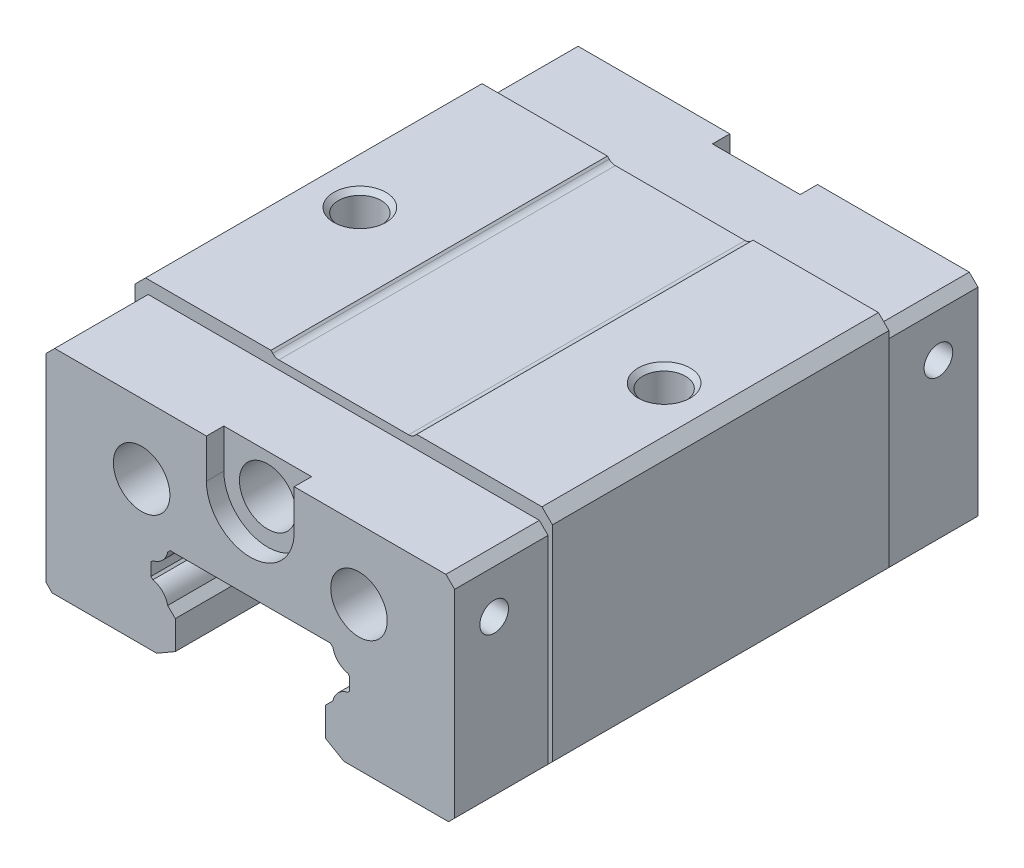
ISO-10303-21;
HEADER;
FILE_DESCRIPTION(('STEP AP214'),'2;1');
FILE_NAME('part.step','',(''),(''),'','','');
FILE_SCHEMA(('AUTOMOTIVE_DESIGN { 1 0 10303 214 1 1 1 1 }'));
ENDSEC;
DATA;
#1=APPLICATION_CONTEXT('core data for automotive mechanical design processes');
#2=APPLICATION_PROTOCOL_DEFINITION('international standard','automotive_design',2000,#1);
#3=PRODUCT_CONTEXT('',#1,'mechanical');
#4=PRODUCT('Part','Part','',(#3));
#5=PRODUCT_RELATED_PRODUCT_CATEGORY('part','',(#4));
#6=PRODUCT_DEFINITION_FORMATION('','',#4);
#7=PRODUCT_DEFINITION_CONTEXT('part definition',#1,'design');
#8=PRODUCT_DEFINITION('design','',#6,#7);
#9=PRODUCT_DEFINITION_SHAPE('','',#8);
#10=(LENGTH_UNIT() NAMED_UNIT(*) SI_UNIT(.MILLI.,.METRE.));
#11=(NAMED_UNIT(*) PLANE_ANGLE_UNIT() SI_UNIT($,.RADIAN.));
#12=(NAMED_UNIT(*) SI_UNIT($,.STERADIAN.) SOLID_ANGLE_UNIT());
#13=UNCERTAINTY_MEASURE_WITH_UNIT(LENGTH_MEASURE(1.E-05),#10,'distance_accuracy_value','');
#14=(GEOMETRIC_REPRESENTATION_CONTEXT(3) GLOBAL_UNCERTAINTY_ASSIGNED_CONTEXT((#13)) GLOBAL_UNIT_ASSIGNED_CONTEXT((#10,
#11,#12)) REPRESENTATION_CONTEXT('',''));
#15=CARTESIAN_POINT('',(0.,0.,0.));
#16=DIRECTION('',(0.,0.,1.));
#17=DIRECTION('',(1.,0.,0.));
#18=AXIS2_PLACEMENT_3D('',#15,#16,#17);
#19=CARTESIAN_POINT('',(-23.5,-26.,-60.2));
#20=DIRECTION('',(0.,0.,-1.));
#21=DIRECTION('',(0.,1.,0.));
#22=AXIS2_PLACEMENT_3D('',#19,#20,#21);
#23=PLANE('',#22);
#24=DIRECTION('',(0.,-1.,0.));
#25=VECTOR('',#24,1.);
#26=CARTESIAN_POINT('',(-5.0466642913,-1.5,-60.2));
#27=LINE('',#26,#25);
#28=CARTESIAN_POINT('',(-5.0466642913,-1.5,-60.2));
#29=VERTEX_POINT('',#28);
#30=CARTESIAN_POINT('',(-5.04666429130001,-6.00001499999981,-60.2));
#31=VERTEX_POINT('',#30);
#32=EDGE_CURVE('E381',#29,#31,#27,.T.);
#33=ORIENTED_EDGE('',*,*,#32,.T.);
#34=CARTESIAN_POINT('',(0.00333570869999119,-6.00001499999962,-60.2));
#35=DIRECTION('',(0.,0.,1.));
#36=DIRECTION('',(0.0257009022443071,-0.999669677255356,0.));
#37=AXIS2_PLACEMENT_3D('',#34,#35,#36);
#38=CIRCLE('',#37,5.05);
#39=CARTESIAN_POINT('',(5.04666429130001,-5.74052163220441,-60.2));
#40=VERTEX_POINT('',#39);
#41=EDGE_CURVE('E369',#31,#40,#38,.T.);
#42=ORIENTED_EDGE('',*,*,#41,.T.);
#43=DIRECTION('',(0.,1.,0.));
#44=VECTOR('',#43,1.);
#45=CARTESIAN_POINT('',(5.0466642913,-5.7405216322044,-60.2));
#46=LINE('',#45,#44);
#47=CARTESIAN_POINT('',(5.0466642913,-1.5,-60.2));
#48=VERTEX_POINT('',#47);
#49=EDGE_CURVE('E380',#40,#48,#46,.T.);
#50=ORIENTED_EDGE('',*,*,#49,.T.);
#51=DIRECTION('',(1.,0.,0.));
#52=VECTOR('',#51,1.);
#53=CARTESIAN_POINT('',(5.0466642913,-1.5,-60.2));
#54=LINE('',#53,#52);
#55=CARTESIAN_POINT('',(22.5,-1.5,-60.2));
#56=VERTEX_POINT('',#55);
#57=EDGE_CURVE('E402',#56,#48,#54,.F.);
#58=ORIENTED_EDGE('',*,*,#57,.F.);
#59=DIRECTION('',(0.707106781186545,-0.70710678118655,0.));
#60=VECTOR('',#59,1.);
#61=CARTESIAN_POINT('',(22.5,-1.5,-60.2));
#62=LINE('',#61,#60);
#63=CARTESIAN_POINT('',(23.5,-2.5,-60.2));
#64=VERTEX_POINT('',#63);
#65=EDGE_CURVE('E407',#64,#56,#62,.F.);
#66=ORIENTED_EDGE('',*,*,#65,.F.);
#67=DIRECTION('',(0.,-1.,0.));
#68=VECTOR('',#67,1.);
#69=CARTESIAN_POINT('',(23.5,-2.5,-60.2));
#70=LINE('',#69,#68);
#71=CARTESIAN_POINT('',(23.5,-25.3,-60.2));
#72=VERTEX_POINT('',#71);
#73=EDGE_CURVE('E411',#72,#64,#70,.F.);
#74=ORIENTED_EDGE('',*,*,#73,.F.);
#75=DIRECTION('',(-0.707106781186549,-0.707106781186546,0.));
#76=VECTOR('',#75,1.);
#77=CARTESIAN_POINT('',(23.5,-25.3,-60.2));
#78=LINE('',#77,#76);
#79=CARTESIAN_POINT('',(22.8,-26.,-60.2));
#80=VERTEX_POINT('',#79);
#81=EDGE_CURVE('E415',#80,#72,#78,.F.);
#82=ORIENTED_EDGE('',*,*,#81,.F.);
#83=DIRECTION('',(-1.,0.,0.));
#84=VECTOR('',#83,1.);
#85=CARTESIAN_POINT('',(22.8,-26.,-60.2));
#86=LINE('',#85,#84);
#87=CARTESIAN_POINT('',(10.7679491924,-26.,-60.2));
#88=VERTEX_POINT('',#87);
#89=EDGE_CURVE('E420',#88,#80,#86,.F.);
#90=ORIENTED_EDGE('',*,*,#89,.F.);
#91=DIRECTION('',(-0.866025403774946,0.500000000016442,0.));
#92=VECTOR('',#91,1.);
#93=CARTESIAN_POINT('',(10.7679491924,-26.,-60.2));
#94=LINE('',#93,#92);
#95=CARTESIAN_POINT('',(8.63,-24.7656544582,-60.2));
#96=VERTEX_POINT('',#95);
#97=EDGE_CURVE('E424',#96,#88,#94,.F.);
#98=ORIENTED_EDGE('',*,*,#97,.F.);
#99=DIRECTION('',(0.,1.,0.));
#100=VECTOR('',#99,1.);
#101=CARTESIAN_POINT('',(8.63,-24.7656544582,-60.2));
#102=LINE('',#101,#100);
#103=CARTESIAN_POINT('',(8.63,-21.478974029,-60.2));
#104=VERTEX_POINT('',#103);
#105=EDGE_CURVE('E429',#104,#96,#102,.F.);
#106=ORIENTED_EDGE('',*,*,#105,.F.);
#107=DIRECTION('',(0.707106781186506,0.707106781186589,0.));
#108=VECTOR('',#107,1.);
#109=CARTESIAN_POINT('',(8.63,-21.478974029,-60.2));
#110=LINE('',#109,#108);
#111=CARTESIAN_POINT('',(9.5027216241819,-20.606252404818,-60.2));
#112=VERTEX_POINT('',#111);
#113=EDGE_CURVE('E434',#112,#104,#110,.F.);
#114=ORIENTED_EDGE('',*,*,#113,.F.);
#115=CARTESIAN_POINT('',(11.6562149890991,-21.0562149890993,-60.2));
#116=DIRECTION('',(0.,0.,-1.));
#117=DIRECTION('',(-0.978860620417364,0.204528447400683,0.));
#118=AXIS2_PLACEMENT_3D('',#115,#116,#117);
#119=CIRCLE('',#118,2.19999999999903);
#120=CARTESIAN_POINT('',(11.206252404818,-18.902721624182,-60.2));
#121=VERTEX_POINT('',#120);
#122=EDGE_CURVE('E439',#121,#112,#119,.F.);
#123=ORIENTED_EDGE('',*,*,#122,.F.);
#124=DIRECTION('',(0.707106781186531,0.707106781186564,0.));
#125=VECTOR('',#124,1.);
#126=CARTESIAN_POINT('',(11.206252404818,-18.902721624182,-60.2));
#127=LINE('',#126,#125);
#128=CARTESIAN_POINT('',(11.43,-18.678974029,-60.2));
#129=VERTEX_POINT('',#128);
#130=EDGE_CURVE('E444',#129,#121,#127,.F.);
#131=ORIENTED_EDGE('',*,*,#130,.F.);
#132=DIRECTION('',(0.,1.,0.));
#133=VECTOR('',#132,1.);
#134=CARTESIAN_POINT('',(11.43,-18.678974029,-60.2));
#135=LINE('',#134,#133);
#136=CARTESIAN_POINT('',(11.43,-17.221025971,-60.2));
#137=VERTEX_POINT('',#136);
#138=EDGE_CURVE('E449',#137,#129,#135,.F.);
#139=ORIENTED_EDGE('',*,*,#138,.F.);
#140=DIRECTION('',(-0.707106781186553,0.707106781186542,0.));
#141=VECTOR('',#140,1.);
#142=CARTESIAN_POINT('',(11.43,-17.221025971,-60.2));
#143=LINE('',#142,#141);
#144=CARTESIAN_POINT('',(11.206252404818,-16.997278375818,-60.2));
#145=VERTEX_POINT('',#144);
#146=EDGE_CURVE('E454',#145,#137,#143,.F.);
#147=ORIENTED_EDGE('',*,*,#146,.F.);
#148=CARTESIAN_POINT('',(11.6562149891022,-14.8437850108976,-60.2));
#149=DIRECTION('',(0.,0.,-1.));
#150=DIRECTION('',(-0.204528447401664,-0.978860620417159,0.));
#151=AXIS2_PLACEMENT_3D('',#148,#149,#150);
#152=CIRCLE('',#151,2.20000000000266);
#153=CARTESIAN_POINT('',(9.5027216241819,-15.293747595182,-60.2));
#154=VERTEX_POINT('',#153);
#155=EDGE_CURVE('E459',#154,#145,#152,.F.);
#156=ORIENTED_EDGE('',*,*,#155,.F.);
#157=DIRECTION('',(-0.707106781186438,0.707106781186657,0.));
#158=VECTOR('',#157,1.);
#159=CARTESIAN_POINT('',(9.50272162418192,-15.293747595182,-60.2));
#160=LINE('',#159,#158);
#161=CARTESIAN_POINT('',(9.208974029,-15.,-60.2));
#162=VERTEX_POINT('',#161);
#163=EDGE_CURVE('E464',#162,#154,#160,.F.);
#164=ORIENTED_EDGE('',*,*,#163,.F.);
#165=DIRECTION('',(-1.,0.,0.));
#166=VECTOR('',#165,1.);
#167=CARTESIAN_POINT('',(9.208974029,-15.,-60.2));
#168=LINE('',#167,#166);
#169=CARTESIAN_POINT('',(-9.208974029,-15.,-60.2));
#170=VERTEX_POINT('',#169);
#171=EDGE_CURVE('E469',#170,#162,#168,.F.);
#172=ORIENTED_EDGE('',*,*,#171,.F.);
#173=DIRECTION('',(-0.707106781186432,-0.707106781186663,0.));
#174=VECTOR('',#173,1.);
#175=CARTESIAN_POINT('',(-9.208974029,-15.,-60.2));
#176=LINE('',#175,#174);
#177=CARTESIAN_POINT('',(-9.5027216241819,-15.293747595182,-60.2));
#178=VERTEX_POINT('',#177);
#179=EDGE_CURVE('E474',#178,#170,#176,.F.);
#180=ORIENTED_EDGE('',*,*,#179,.F.);
#181=CARTESIAN_POINT('',(-11.6562149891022,-14.8437850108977,-60.2));
#182=DIRECTION('',(0.,0.,-1.));
#183=DIRECTION('',(0.978860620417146,-0.204528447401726,0.));
#184=AXIS2_PLACEMENT_3D('',#181,#182,#183);
#185=CIRCLE('',#184,2.20000000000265);
#186=CARTESIAN_POINT('',(-11.206252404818,-16.997278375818,-60.2));
#187=VERTEX_POINT('',#186);
#188=EDGE_CURVE('E479',#187,#178,#185,.F.);
#189=ORIENTED_EDGE('',*,*,#188,.F.);
#190=DIRECTION('',(-0.70710678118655,-0.707106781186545,0.));
#191=VECTOR('',#190,1.);
#192=CARTESIAN_POINT('',(-11.206252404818,-16.997278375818,-60.2));
#193=LINE('',#192,#191);
#194=CARTESIAN_POINT('',(-11.43,-17.221025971,-60.2));
#195=VERTEX_POINT('',#194);
#196=EDGE_CURVE('E484',#195,#187,#193,.F.);
#197=ORIENTED_EDGE('',*,*,#196,.F.);
#198=DIRECTION('',(0.,-1.,0.));
#199=VECTOR('',#198,1.);
#200=CARTESIAN_POINT('',(-11.43,-17.221025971,-60.2));
#201=LINE('',#200,#199);
#202=CARTESIAN_POINT('',(-11.43,-18.678974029,-60.2));
#203=VERTEX_POINT('',#202);
#204=EDGE_CURVE('E489',#203,#195,#201,.F.);
#205=ORIENTED_EDGE('',*,*,#204,.F.);
#206=DIRECTION('',(0.707106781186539,-0.707106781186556,0.));
#207=VECTOR('',#206,1.);
#208=CARTESIAN_POINT('',(-11.43,-18.678974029,-60.2));
#209=LINE('',#208,#207);
#210=CARTESIAN_POINT('',(-11.206252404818,-18.902721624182,-60.2));
#211=VERTEX_POINT('',#210);
#212=EDGE_CURVE('E494',#211,#203,#209,.F.);
#213=ORIENTED_EDGE('',*,*,#212,.F.);
#214=CARTESIAN_POINT('',(-11.6562149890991,-21.0562149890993,-60.2));
#215=DIRECTION('',(0.,0.,-1.));
#216=DIRECTION('',(0.204528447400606,0.97886062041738,0.));
#217=AXIS2_PLACEMENT_3D('',#214,#215,#216);
#218=CIRCLE('',#217,2.19999999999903);
#219=CARTESIAN_POINT('',(-9.50272162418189,-20.606252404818,-60.2));
#220=VERTEX_POINT('',#219);
#221=EDGE_CURVE('E499',#220,#211,#218,.F.);
#222=ORIENTED_EDGE('',*,*,#221,.F.);
#223=DIRECTION('',(0.707106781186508,-0.707106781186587,0.));
#224=VECTOR('',#223,1.);
#225=CARTESIAN_POINT('',(-9.5027216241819,-20.606252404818,-60.2));
#226=LINE('',#225,#224);
#227=CARTESIAN_POINT('',(-8.63,-21.478974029,-60.2));
#228=VERTEX_POINT('',#227);
#229=EDGE_CURVE('E504',#228,#220,#226,.F.);
#230=ORIENTED_EDGE('',*,*,#229,.F.);
#231=DIRECTION('',(0.,-1.,0.));
#232=VECTOR('',#231,1.);
#233=CARTESIAN_POINT('',(-8.63,-21.478974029,-60.2));
#234=LINE('',#233,#232);
#235=CARTESIAN_POINT('',(-8.63,-24.7656544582,-60.2));
#236=VERTEX_POINT('',#235);
#237=EDGE_CURVE('E509',#236,#228,#234,.F.);
#238=ORIENTED_EDGE('',*,*,#237,.F.);
#239=DIRECTION('',(-0.866025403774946,-0.500000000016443,0.));
#240=VECTOR('',#239,1.);
#241=CARTESIAN_POINT('',(-8.63,-24.7656544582,-60.2));
#242=LINE('',#241,#240);
#243=CARTESIAN_POINT('',(-10.7679491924,-26.,-60.2));
#244=VERTEX_POINT('',#243);
#245=EDGE_CURVE('E514',#244,#236,#242,.F.);
#246=ORIENTED_EDGE('',*,*,#245,.F.);
#247=DIRECTION('',(-1.,0.,0.));
#248=VECTOR('',#247,1.);
#249=CARTESIAN_POINT('',(-10.7679491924,-26.,-60.2));
#250=LINE('',#249,#248);
#251=CARTESIAN_POINT('',(-22.8,-26.,-60.2));
#252=VERTEX_POINT('',#251);
#253=EDGE_CURVE('E519',#252,#244,#250,.F.);
#254=ORIENTED_EDGE('',*,*,#253,.F.);
#255=DIRECTION('',(-0.707106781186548,0.707106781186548,0.));
#256=VECTOR('',#255,1.);
#257=CARTESIAN_POINT('',(-22.8,-26.,-60.2));
#258=LINE('',#257,#256);
#259=CARTESIAN_POINT('',(-23.5,-25.3,-60.2));
#260=VERTEX_POINT('',#259);
#261=EDGE_CURVE('E524',#260,#252,#258,.F.);
#262=ORIENTED_EDGE('',*,*,#261,.F.);
#263=DIRECTION('',(0.,1.,0.));
#264=VECTOR('',#263,1.);
#265=CARTESIAN_POINT('',(-23.5,-25.3,-60.2));
#266=LINE('',#265,#264);
#267=CARTESIAN_POINT('',(-23.5,-2.5,-60.2));
#268=VERTEX_POINT('',#267);
#269=EDGE_CURVE('E529',#268,#260,#266,.F.);
#270=ORIENTED_EDGE('',*,*,#269,.F.);
#271=DIRECTION('',(0.707106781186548,0.707106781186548,0.));
#272=VECTOR('',#271,1.);
#273=CARTESIAN_POINT('',(-23.5,-2.5,-60.2));
#274=LINE('',#273,#272);
#275=CARTESIAN_POINT('',(-22.5,-1.5,-60.2));
#276=VERTEX_POINT('',#275);
#277=EDGE_CURVE('E533',#276,#268,#274,.F.);
#278=ORIENTED_EDGE('',*,*,#277,.F.);
#279=DIRECTION('',(1.,0.,0.));
#280=VECTOR('',#279,1.);
#281=CARTESIAN_POINT('',(-22.5,-1.5,-60.2));
#282=LINE('',#281,#280);
#283=EDGE_CURVE('E394',#29,#276,#282,.F.);
#284=ORIENTED_EDGE('',*,*,#283,.F.);
#285=EDGE_LOOP('',(#33,#42,#50,#58,#66,#74,#82,#90,#98,#106,#114,#123,#131,#139,#147,#156,#164,
#172,#180,#189,#197,#205,#213,#222,#230,#238,#246,#254,#262,#270,#278,#284));
#286=FACE_BOUND('',#285,.T.);
#287=CARTESIAN_POINT('',(-12.4995,-9.5,-60.2));
#288=DIRECTION('',(0.,0.,1.));
#289=DIRECTION('',(-1.,0.,0.));
#290=AXIS2_PLACEMENT_3D('',#287,#288,#289);
#291=CIRCLE('',#290,3.25);
#292=CARTESIAN_POINT('',(-15.7495,-9.5,-60.2));
#293=VERTEX_POINT('',#292);
#294=EDGE_CURVE('E541',#293,#293,#291,.T.);
#295=ORIENTED_EDGE('',*,*,#294,.T.);
#296=EDGE_LOOP('',(#295));
#297=FACE_BOUND('',#296,.T.);
#298=CARTESIAN_POINT('',(12.4995,-9.5,-60.2));
#299=DIRECTION('',(0.,0.,1.));
#300=DIRECTION('',(-1.,0.,0.));
#301=AXIS2_PLACEMENT_3D('',#298,#299,#300);
#302=CIRCLE('',#301,3.25);
#303=CARTESIAN_POINT('',(9.2495,-9.5,-60.2));
#304=VERTEX_POINT('',#303);
#305=EDGE_CURVE('E546',#304,#304,#302,.T.);
#306=ORIENTED_EDGE('',*,*,#305,.T.);
#307=EDGE_LOOP('',(#306));
#308=FACE_BOUND('',#307,.T.);
#309=ADVANCED_FACE('F17',(#286,#297,#308),#23,.T.);
#310=CARTESIAN_POINT('',(-22.5,-1.5,-49.45));
#311=DIRECTION('',(0.,1.,0.));
#312=DIRECTION('',(1.,0.,0.));
#313=AXIS2_PLACEMENT_3D('',#310,#311,#312);
#314=PLANE('',#313);
#315=DIRECTION('',(0.,0.,-1.));
#316=VECTOR('',#315,1.);
#317=CARTESIAN_POINT('',(-5.0466642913,-1.5,-58.2));
#318=LINE('',#317,#316);
#319=CARTESIAN_POINT('',(-5.0466642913,-1.5,-58.2));
#320=VERTEX_POINT('',#319);
#321=EDGE_CURVE('E549',#29,#320,#318,.F.);
#322=ORIENTED_EDGE('',*,*,#321,.F.);
#323=ORIENTED_EDGE('',*,*,#283,.T.);
#324=DIRECTION('',(0.,0.,1.));
#325=VECTOR('',#324,1.);
#326=CARTESIAN_POINT('',(-22.5,-1.5,-60.2));
#327=LINE('',#326,#325);
#328=CARTESIAN_POINT('',(-22.5,-1.5,-49.45));
#329=VERTEX_POINT('',#328);
#330=EDGE_CURVE('E551',#329,#276,#327,.F.);
#331=ORIENTED_EDGE('',*,*,#330,.F.);
#332=DIRECTION('',(1.,0.,0.));
#333=VECTOR('',#332,1.);
#334=CARTESIAN_POINT('',(-22.5,-1.5,-49.45));
#335=LINE('',#334,#333);
#336=CARTESIAN_POINT('',(22.5,-1.5,-49.45));
#337=VERTEX_POINT('',#336);
#338=EDGE_CURVE('E555',#337,#329,#335,.F.);
#339=ORIENTED_EDGE('',*,*,#338,.F.);
#340=DIRECTION('',(0.,0.,-1.));
#341=VECTOR('',#340,1.);
#342=CARTESIAN_POINT('',(22.5,-1.5,-49.45));
#343=LINE('',#342,#341);
#344=EDGE_CURVE('E559',#337,#56,#343,.T.);
#345=ORIENTED_EDGE('',*,*,#344,.T.);
#346=ORIENTED_EDGE('',*,*,#57,.T.);
#347=DIRECTION('',(0.,0.,1.));
#348=VECTOR('',#347,1.);
#349=CARTESIAN_POINT('',(5.0466642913,-1.5,-60.2));
#350=LINE('',#349,#348);
#351=CARTESIAN_POINT('',(5.0466642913,-1.5,-58.2));
#352=VERTEX_POINT('',#351);
#353=EDGE_CURVE('E564',#352,#48,#350,.F.);
#354=ORIENTED_EDGE('',*,*,#353,.F.);
#355=DIRECTION('',(-1.,0.,0.));
#356=VECTOR('',#355,1.);
#357=CARTESIAN_POINT('',(5.0466642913,-1.5,-58.2));
#358=LINE('',#357,#356);
#359=EDGE_CURVE('E568',#352,#320,#358,.T.);
#360=ORIENTED_EDGE('',*,*,#359,.T.);
#361=EDGE_LOOP('',(#322,#323,#331,#339,#345,#346,#354,#360));
#362=FACE_BOUND('',#361,.T.);
#363=ADVANCED_FACE('F1271',(#362),#314,.T.);
#364=CARTESIAN_POINT('',(-24.,-8.,-49.45));
#365=DIRECTION('',(-1.,0.,0.));
#366=DIRECTION('',(0.,0.,1.));
#367=AXIS2_PLACEMENT_3D('',#364,#365,#366);
#368=PLANE('',#367);
#369=DIRECTION('',(0.,-1.,0.));
#370=VECTOR('',#369,1.);
#371=CARTESIAN_POINT('',(-24.,-1.2,-49.45));
#372=LINE('',#371,#370);
#373=CARTESIAN_POINT('',(-24.,-8.,-49.45));
#374=VERTEX_POINT('',#373);
#375=CARTESIAN_POINT('',(-24.,-1.2,-49.45));
#376=VERTEX_POINT('',#375);
#377=EDGE_CURVE('E573',#374,#376,#372,.F.);
#378=ORIENTED_EDGE('',*,*,#377,.F.);
#379=DIRECTION('',(0.,0.,1.));
#380=VECTOR('',#379,1.);
#381=CARTESIAN_POINT('',(-24.,-8.,-49.45));
#382=LINE('',#381,#380);
#383=CARTESIAN_POINT('',(-24.,-8.,-10.75));
#384=VERTEX_POINT('',#383);
#385=EDGE_CURVE('E577',#374,#384,#382,.T.);
#386=ORIENTED_EDGE('',*,*,#385,.T.);
#387=DIRECTION('',(0.,1.,0.));
#388=VECTOR('',#387,1.);
#389=CARTESIAN_POINT('',(-24.,-8.,-10.75));
#390=LINE('',#389,#388);
#391=CARTESIAN_POINT('',(-24.,-1.2,-10.75));
#392=VERTEX_POINT('',#391);
#393=EDGE_CURVE('E582',#384,#392,#390,.T.);
#394=ORIENTED_EDGE('',*,*,#393,.T.);
#395=DIRECTION('',(0.,0.,-1.));
#396=VECTOR('',#395,1.);
#397=CARTESIAN_POINT('',(-24.,-1.2,-10.75));
#398=LINE('',#397,#396);
#399=EDGE_CURVE('E587',#376,#392,#398,.F.);
#400=ORIENTED_EDGE('',*,*,#399,.F.);
#401=EDGE_LOOP('',(#378,#386,#394,#400));
#402=FACE_BOUND('',#401,.T.);
#403=ADVANCED_FACE('F1276',(#402),#368,.T.);
#404=CARTESIAN_POINT('',(-24.,-8.,-49.45));
#405=DIRECTION('',(-0.707106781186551,-0.707106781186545,0.));
#406=DIRECTION('',(0.707106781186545,-0.707106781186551,0.));
#407=AXIS2_PLACEMENT_3D('',#404,#405,#406);
#408=PLANE('',#407);
#409=DIRECTION('',(0.707106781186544,-0.707106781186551,0.));
#410=VECTOR('',#409,1.);
#411=CARTESIAN_POINT('',(-24.,-8.,-49.45));
#412=LINE('',#411,#410);
#413=CARTESIAN_POINT('',(-23.6,-8.4,-49.45));
#414=VERTEX_POINT('',#413);
#415=EDGE_CURVE('E592',#414,#374,#412,.F.);
#416=ORIENTED_EDGE('',*,*,#415,.F.);
#417=DIRECTION('',(0.,0.,1.));
#418=VECTOR('',#417,1.);
#419=CARTESIAN_POINT('',(-23.6,-8.4,-49.45));
#420=LINE('',#419,#418);
#421=CARTESIAN_POINT('',(-23.6,-8.4,-10.75));
#422=VERTEX_POINT('',#421);
#423=EDGE_CURVE('E596',#414,#422,#420,.T.);
#424=ORIENTED_EDGE('',*,*,#423,.T.);
#425=DIRECTION('',(-0.707106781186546,0.707106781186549,0.));
#426=VECTOR('',#425,1.);
#427=CARTESIAN_POINT('',(-23.6,-8.4,-10.75));
#428=LINE('',#427,#426);
#429=EDGE_CURVE('E601',#422,#384,#428,.T.);
#430=ORIENTED_EDGE('',*,*,#429,.T.);
#431=ORIENTED_EDGE('',*,*,#385,.F.);
#432=EDGE_LOOP('',(#416,#424,#430,#431));
#433=FACE_BOUND('',#432,.T.);
#434=ADVANCED_FACE('F1282',(#433),#408,.T.);
#435=CARTESIAN_POINT('',(-23.6,-25.2,-49.45));
#436=DIRECTION('',(-1.,0.,0.));
#437=DIRECTION('',(0.,0.,1.));
#438=AXIS2_PLACEMENT_3D('',#435,#436,#437);
#439=PLANE('',#438);
#440=DIRECTION('',(0.,-1.,0.));
#441=VECTOR('',#440,1.);
#442=CARTESIAN_POINT('',(-23.6,-8.4,-49.45));
#443=LINE('',#442,#441);
#444=CARTESIAN_POINT('',(-23.6,-25.2,-49.45));
#445=VERTEX_POINT('',#444);
#446=EDGE_CURVE('E606',#445,#414,#443,.F.);
#447=ORIENTED_EDGE('',*,*,#446,.F.);
#448=DIRECTION('',(0.,0.,1.));
#449=VECTOR('',#448,1.);
#450=CARTESIAN_POINT('',(-23.6,-25.2,-49.45));
#451=LINE('',#450,#449);
#452=CARTESIAN_POINT('',(-23.6,-25.2,-10.75));
#453=VERTEX_POINT('',#452);
#454=EDGE_CURVE('E610',#445,#453,#451,.T.);
#455=ORIENTED_EDGE('',*,*,#454,.T.);
#456=DIRECTION('',(0.,1.,0.));
#457=VECTOR('',#456,1.);
#458=CARTESIAN_POINT('',(-23.6,-25.2,-10.75));
#459=LINE('',#458,#457);
#460=EDGE_CURVE('E615',#453,#422,#459,.T.);
#461=ORIENTED_EDGE('',*,*,#460,.T.);
#462=ORIENTED_EDGE('',*,*,#423,.F.);
#463=EDGE_LOOP('',(#447,#455,#461,#462));
#464=FACE_BOUND('',#463,.T.);
#465=ADVANCED_FACE('F1286',(#464),#439,.T.);
#466=CARTESIAN_POINT('',(-23.6,-25.2,-60.2));
#467=DIRECTION('',(-0.707106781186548,-0.707106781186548,0.));
#468=DIRECTION('',(0.707106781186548,-0.707106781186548,0.));
#469=AXIS2_PLACEMENT_3D('',#466,#467,#468);
#470=PLANE('',#469);
#471=DIRECTION('',(0.707106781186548,-0.707106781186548,0.));
#472=VECTOR('',#471,1.);
#473=CARTESIAN_POINT('',(-23.6,-25.2,-49.45));
#474=LINE('',#473,#472);
#475=CARTESIAN_POINT('',(-23.5,-25.3,-49.45));
#476=VERTEX_POINT('',#475);
#477=EDGE_CURVE('E620',#476,#445,#474,.F.);
#478=ORIENTED_EDGE('',*,*,#477,.F.);
#479=DIRECTION('',(0.,0.,-1.));
#480=VECTOR('',#479,1.);
#481=CARTESIAN_POINT('',(-23.5,-25.3,-49.45));
#482=LINE('',#481,#480);
#483=EDGE_CURVE('E624',#476,#260,#482,.T.);
#484=ORIENTED_EDGE('',*,*,#483,.T.);
#485=ORIENTED_EDGE('',*,*,#261,.T.);
#486=DIRECTION('',(0.,0.,1.));
#487=VECTOR('',#486,1.);
#488=CARTESIAN_POINT('',(-22.8,-26.,-60.2));
#489=LINE('',#488,#487);
#490=CARTESIAN_POINT('',(-22.8,-26.,0.));
#491=VERTEX_POINT('',#490);
#492=EDGE_CURVE('E629',#252,#491,#489,.T.);
#493=ORIENTED_EDGE('',*,*,#492,.T.);
#494=DIRECTION('',(-0.707106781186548,0.707106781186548,0.));
#495=VECTOR('',#494,1.);
#496=CARTESIAN_POINT('',(-22.8,-26.,0.));
#497=LINE('',#496,#495);
#498=CARTESIAN_POINT('',(-23.5,-25.3,0.));
#499=VERTEX_POINT('',#498);
#500=EDGE_CURVE('E634',#499,#491,#497,.F.);
#501=ORIENTED_EDGE('',*,*,#500,.F.);
#502=DIRECTION('',(0.,0.,-1.));
#503=VECTOR('',#502,1.);
#504=CARTESIAN_POINT('',(-23.5,-25.3,0.));
#505=LINE('',#504,#503);
#506=CARTESIAN_POINT('',(-23.5,-25.3,-10.75));
#507=VERTEX_POINT('',#506);
#508=EDGE_CURVE('E639',#507,#499,#505,.F.);
#509=ORIENTED_EDGE('',*,*,#508,.F.);
#510=DIRECTION('',(-0.707106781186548,0.707106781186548,0.));
#511=VECTOR('',#510,1.);
#512=CARTESIAN_POINT('',(-23.5,-25.3,-10.75));
#513=LINE('',#512,#511);
#514=EDGE_CURVE('E643',#507,#453,#513,.T.);
#515=ORIENTED_EDGE('',*,*,#514,.T.);
#516=ORIENTED_EDGE('',*,*,#454,.F.);
#517=EDGE_LOOP('',(#478,#484,#485,#493,#501,#509,#515,#516));
#518=FACE_BOUND('',#517,.T.);
#519=ADVANCED_FACE('F1290',(#518),#470,.T.);
#520=CARTESIAN_POINT('',(22.8,-26.,-60.2));
#521=DIRECTION('',(0.707106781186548,-0.707106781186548,0.));
#522=DIRECTION('',(0.707106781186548,0.707106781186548,0.));
#523=AXIS2_PLACEMENT_3D('',#520,#521,#522);
#524=PLANE('',#523);
#525=DIRECTION('',(0.707106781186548,0.707106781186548,0.));
#526=VECTOR('',#525,1.);
#527=CARTESIAN_POINT('',(23.5,-25.3,-49.45));
#528=LINE('',#527,#526);
#529=CARTESIAN_POINT('',(24.,-24.8,-49.45));
#530=VERTEX_POINT('',#529);
#531=CARTESIAN_POINT('',(23.5,-25.3,-49.45));
#532=VERTEX_POINT('',#531);
#533=EDGE_CURVE('E648',#530,#532,#528,.F.);
#534=ORIENTED_EDGE('',*,*,#533,.F.);
#535=DIRECTION('',(0.,0.,1.));
#536=VECTOR('',#535,1.);
#537=CARTESIAN_POINT('',(24.,-24.8,-49.45));
#538=LINE('',#537,#536);
#539=CARTESIAN_POINT('',(24.,-24.8,-10.75));
#540=VERTEX_POINT('',#539);
#541=EDGE_CURVE('E652',#530,#540,#538,.T.);
#542=ORIENTED_EDGE('',*,*,#541,.T.);
#543=DIRECTION('',(-0.707106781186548,-0.707106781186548,0.));
#544=VECTOR('',#543,1.);
#545=CARTESIAN_POINT('',(24.,-24.8,-10.75));
#546=LINE('',#545,#544);
#547=CARTESIAN_POINT('',(23.5,-25.3,-10.75));
#548=VERTEX_POINT('',#547);
#549=EDGE_CURVE('E657',#540,#548,#546,.T.);
#550=ORIENTED_EDGE('',*,*,#549,.T.);
#551=DIRECTION('',(0.,0.,1.));
#552=VECTOR('',#551,1.);
#553=CARTESIAN_POINT('',(23.5,-25.3,-10.75));
#554=LINE('',#553,#552);
#555=CARTESIAN_POINT('',(23.5,-25.3,0.));
#556=VERTEX_POINT('',#555);
#557=EDGE_CURVE('E662',#548,#556,#554,.T.);
#558=ORIENTED_EDGE('',*,*,#557,.T.);
#559=DIRECTION('',(-0.707106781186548,-0.707106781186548,0.));
#560=VECTOR('',#559,1.);
#561=CARTESIAN_POINT('',(23.5,-25.3,0.));
#562=LINE('',#561,#560);
#563=CARTESIAN_POINT('',(22.8,-26.,0.));
#564=VERTEX_POINT('',#563);
#565=EDGE_CURVE('E667',#564,#556,#562,.F.);
#566=ORIENTED_EDGE('',*,*,#565,.F.);
#567=DIRECTION('',(0.,0.,-1.));
#568=VECTOR('',#567,1.);
#569=CARTESIAN_POINT('',(22.8,-26.,0.));
#570=LINE('',#569,#568);
#571=EDGE_CURVE('E672',#80,#564,#570,.F.);
#572=ORIENTED_EDGE('',*,*,#571,.F.);
#573=ORIENTED_EDGE('',*,*,#81,.T.);
#574=DIRECTION('',(0.,0.,1.));
#575=VECTOR('',#574,1.);
#576=CARTESIAN_POINT('',(23.5,-25.3,-60.2));
#577=LINE('',#576,#575);
#578=EDGE_CURVE('E676',#532,#72,#577,.F.);
#579=ORIENTED_EDGE('',*,*,#578,.F.);
#580=EDGE_LOOP('',(#534,#542,#550,#558,#566,#572,#573,#579));
#581=FACE_BOUND('',#580,.T.);
#582=ADVANCED_FACE('F1294',(#581),#524,.T.);
#583=CARTESIAN_POINT('',(24.,-24.8,-10.75));
#584=DIRECTION('',(1.,0.,0.));
#585=DIRECTION('',(0.,0.,-1.));
#586=AXIS2_PLACEMENT_3D('',#583,#584,#585);
#587=PLANE('',#586);
#588=DIRECTION('',(0.,1.,0.));
#589=VECTOR('',#588,1.);
#590=CARTESIAN_POINT('',(24.,-24.8,-49.45));
#591=LINE('',#590,#589);
#592=CARTESIAN_POINT('',(24.,-1.2,-49.45));
#593=VERTEX_POINT('',#592);
#594=EDGE_CURVE('E680',#593,#530,#591,.F.);
#595=ORIENTED_EDGE('',*,*,#594,.F.);
#596=DIRECTION('',(0.,0.,1.));
#597=VECTOR('',#596,1.);
#598=CARTESIAN_POINT('',(24.,-1.2,-49.45));
#599=LINE('',#598,#597);
#600=CARTESIAN_POINT('',(24.,-1.2,-10.75));
#601=VERTEX_POINT('',#600);
#602=EDGE_CURVE('E684',#593,#601,#599,.T.);
#603=ORIENTED_EDGE('',*,*,#602,.T.);
#604=DIRECTION('',(0.,-1.,0.));
#605=VECTOR('',#604,1.);
#606=CARTESIAN_POINT('',(24.,-1.2,-10.75));
#607=LINE('',#606,#605);
#608=EDGE_CURVE('E689',#601,#540,#607,.T.);
#609=ORIENTED_EDGE('',*,*,#608,.T.);
#610=ORIENTED_EDGE('',*,*,#541,.F.);
#611=EDGE_LOOP('',(#595,#603,#609,#610));
#612=FACE_BOUND('',#611,.T.);
#613=ADVANCED_FACE('F1298',(#612),#587,.T.);
#614=CARTESIAN_POINT('',(24.,-1.2,-49.45));
#615=DIRECTION('',(0.707106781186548,0.707106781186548,0.));
#616=DIRECTION('',(-0.707106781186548,0.707106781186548,0.));
#617=AXIS2_PLACEMENT_3D('',#614,#615,#616);
#618=PLANE('',#617);
#619=DIRECTION('',(-0.707106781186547,0.707106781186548,0.));
#620=VECTOR('',#619,1.);
#621=CARTESIAN_POINT('',(24.,-1.2,-49.45));
#622=LINE('',#621,#620);
#623=CARTESIAN_POINT('',(22.8,0.,-49.45));
#624=VERTEX_POINT('',#623);
#625=EDGE_CURVE('E694',#624,#593,#622,.F.);
#626=ORIENTED_EDGE('',*,*,#625,.F.);
#627=DIRECTION('',(0.,0.,1.));
#628=VECTOR('',#627,1.);
#629=CARTESIAN_POINT('',(22.8,0.,-49.45));
#630=LINE('',#629,#628);
#631=CARTESIAN_POINT('',(22.8,0.,-10.75));
#632=VERTEX_POINT('',#631);
#633=EDGE_CURVE('E698',#624,#632,#630,.T.);
#634=ORIENTED_EDGE('',*,*,#633,.T.);
#635=DIRECTION('',(0.707106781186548,-0.707106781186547,0.));
#636=VECTOR('',#635,1.);
#637=CARTESIAN_POINT('',(22.8,0.,-10.75));
#638=LINE('',#637,#636);
#639=EDGE_CURVE('E703',#632,#601,#638,.T.);
#640=ORIENTED_EDGE('',*,*,#639,.T.);
#641=ORIENTED_EDGE('',*,*,#602,.F.);
#642=EDGE_LOOP('',(#626,#634,#640,#641));
#643=FACE_BOUND('',#642,.T.);
#644=ADVANCED_FACE('F1302',(#643),#618,.T.);
#645=CARTESIAN_POINT('',(8.3757359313,0.,-49.45));
#646=DIRECTION('',(0.,1.,0.));
#647=DIRECTION('',(0.,0.,1.));
#648=AXIS2_PLACEMENT_3D('',#645,#646,#647);
#649=PLANE('',#648);
#650=DIRECTION('',(-1.,0.,0.));
#651=VECTOR('',#650,1.);
#652=CARTESIAN_POINT('',(22.8,0.,-49.45));
#653=LINE('',#652,#651);
#654=CARTESIAN_POINT('',(8.3757359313,0.,-49.45));
#655=VERTEX_POINT('',#654);
#656=EDGE_CURVE('E708',#655,#624,#653,.F.);
#657=ORIENTED_EDGE('',*,*,#656,.F.);
#658=DIRECTION('',(0.,0.,1.));
#659=VECTOR('',#658,1.);
#660=CARTESIAN_POINT('',(8.3757359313,0.,-49.45));
#661=LINE('',#660,#659);
#662=CARTESIAN_POINT('',(8.3757359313,0.,-10.75));
#663=VERTEX_POINT('',#662);
#664=EDGE_CURVE('E712',#655,#663,#661,.T.);
#665=ORIENTED_EDGE('',*,*,#664,.T.);
#666=DIRECTION('',(1.,0.,0.));
#667=VECTOR('',#666,1.);
#668=CARTESIAN_POINT('',(8.3757359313,0.,-10.75));
#669=LINE('',#668,#667);
#670=EDGE_CURVE('E717',#663,#632,#669,.T.);
#671=ORIENTED_EDGE('',*,*,#670,.T.);
#672=ORIENTED_EDGE('',*,*,#633,.F.);
#673=EDGE_LOOP('',(#657,#665,#671,#672));
#674=FACE_BOUND('',#673,.T.);
#675=CARTESIAN_POINT('',(17.5,0.,-30.1));
#676=DIRECTION('',(0.,-1.,0.));
#677=DIRECTION('',(-1.42053861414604E-07,0.,0.99999999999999));
#678=AXIS2_PLACEMENT_3D('',#675,#676,#677);
#679=CIRCLE('',#678,3.);
#680=CARTESIAN_POINT('',(17.4999995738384,0.,-27.1));
#681=VERTEX_POINT('',#680);
#682=EDGE_CURVE('E722',#681,#681,#679,.T.);
#683=ORIENTED_EDGE('',*,*,#682,.T.);
#684=EDGE_LOOP('',(#683));
#685=FACE_BOUND('',#684,.T.);
#686=ADVANCED_FACE('F1306',(#674,#685),#649,.T.);
#687=CARTESIAN_POINT('',(8.3757359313,0.,-49.45));
#688=DIRECTION('',(-0.707106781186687,0.707106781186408,0.));
#689=DIRECTION('',(-0.707106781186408,-0.707106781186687,0.));
#690=AXIS2_PLACEMENT_3D('',#687,#688,#689);
#691=PLANE('',#690);
#692=DIRECTION('',(-0.707106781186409,-0.707106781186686,0.));
#693=VECTOR('',#692,1.);
#694=CARTESIAN_POINT('',(8.3757359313,0.,-49.45));
#695=LINE('',#694,#693);
#696=CARTESIAN_POINT('',(8.1686291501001,-0.207106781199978,-49.45));
#697=VERTEX_POINT('',#696);
#698=EDGE_CURVE('E727',#697,#655,#695,.F.);
#699=ORIENTED_EDGE('',*,*,#698,.F.);
#700=DIRECTION('',(0.,0.,1.));
#701=VECTOR('',#700,1.);
#702=CARTESIAN_POINT('',(8.1686291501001,-0.207106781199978,-49.45));
#703=LINE('',#702,#701);
#704=CARTESIAN_POINT('',(8.1686291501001,-0.207106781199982,-10.75));
#705=VERTEX_POINT('',#704);
#706=EDGE_CURVE('E729',#697,#705,#703,.T.);
#707=ORIENTED_EDGE('',*,*,#706,.T.);
#708=DIRECTION('',(0.707106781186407,0.707106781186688,0.));
#709=VECTOR('',#708,1.);
#710=CARTESIAN_POINT('',(8.1686291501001,-0.207106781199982,-10.75));
#711=LINE('',#710,#709);
#712=EDGE_CURVE('E734',#705,#663,#711,.T.);
#713=ORIENTED_EDGE('',*,*,#712,.T.);
#714=ORIENTED_EDGE('',*,*,#664,.F.);
#715=EDGE_LOOP('',(#699,#707,#713,#714));
#716=FACE_BOUND('',#715,.T.);
#717=ADVANCED_FACE('F1310',(#716),#691,.T.);
#718=CARTESIAN_POINT('',(7.46152236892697,0.50000000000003,-60.2));
#719=DIRECTION('',(0.,0.,1.));
#720=DIRECTION('',(-2.69706095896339E-11,-1.,0.));
#721=AXIS2_PLACEMENT_3D('',#718,#719,#720);
#722=CYLINDRICAL_SURFACE('',#721,1.00000000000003);
#723=ORIENTED_EDGE('',*,*,#706,.F.);
#724=CARTESIAN_POINT('',(7.46152236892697,0.50000000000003,-49.45));
#725=DIRECTION('',(0.,0.,-1.));
#726=DIRECTION('',(0.70710678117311,-0.707106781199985,0.));
#727=AXIS2_PLACEMENT_3D('',#724,#725,#726);
#728=CIRCLE('',#727,1.00000000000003);
#729=CARTESIAN_POINT('',(7.4615223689,-0.5,-49.45));
#730=VERTEX_POINT('',#729);
#731=EDGE_CURVE('E739',#697,#730,#728,.T.);
#732=ORIENTED_EDGE('',*,*,#731,.T.);
#733=DIRECTION('',(0.,0.,1.));
#734=VECTOR('',#733,1.);
#735=CARTESIAN_POINT('',(7.4615223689,-0.5,-49.45));
#736=LINE('',#735,#734);
#737=CARTESIAN_POINT('',(7.4615223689,-0.5,-10.75));
#738=VERTEX_POINT('',#737);
#739=EDGE_CURVE('E744',#730,#738,#736,.T.);
#740=ORIENTED_EDGE('',*,*,#739,.T.);
#741=CARTESIAN_POINT('',(7.46152236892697,0.50000000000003,-10.75));
#742=DIRECTION('',(0.,0.,1.));
#743=DIRECTION('',(-2.69704258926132E-11,-1.,0.));
#744=AXIS2_PLACEMENT_3D('',#741,#742,#743);
#745=CIRCLE('',#744,1.00000000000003);
#746=EDGE_CURVE('E749',#705,#738,#745,.F.);
#747=ORIENTED_EDGE('',*,*,#746,.F.);
#748=EDGE_LOOP('',(#723,#732,#740,#747));
#749=FACE_BOUND('',#748,.T.);
#750=ADVANCED_FACE('F1314',(#749),#722,.F.);
#751=CARTESIAN_POINT('',(-7.4615223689,-0.5,-49.45));
#752=DIRECTION('',(0.,1.,0.));
#753=DIRECTION('',(0.,0.,1.));
#754=AXIS2_PLACEMENT_3D('',#751,#752,#753);
#755=PLANE('',#754);
#756=DIRECTION('',(-1.,0.,0.));
#757=VECTOR('',#756,1.);
#758=CARTESIAN_POINT('',(7.4615223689,-0.5,-49.45));
#759=LINE('',#758,#757);
#760=CARTESIAN_POINT('',(-7.4615223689,-0.5,-49.45));
#761=VERTEX_POINT('',#760);
#762=EDGE_CURVE('E753',#761,#730,#759,.F.);
#763=ORIENTED_EDGE('',*,*,#762,.F.);
#764=DIRECTION('',(0.,0.,1.));
#765=VECTOR('',#764,1.);
#766=CARTESIAN_POINT('',(-7.4615223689,-0.5,-49.45));
#767=LINE('',#766,#765);
#768=CARTESIAN_POINT('',(-7.4615223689,-0.5,-10.75));
#769=VERTEX_POINT('',#768);
#770=EDGE_CURVE('E757',#761,#769,#767,.T.);
#771=ORIENTED_EDGE('',*,*,#770,.T.);
#772=DIRECTION('',(1.,0.,0.));
#773=VECTOR('',#772,1.);
#774=CARTESIAN_POINT('',(-7.4615223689,-0.5,-10.75));
#775=LINE('',#774,#773);
#776=EDGE_CURVE('E762',#769,#738,#775,.T.);
#777=ORIENTED_EDGE('',*,*,#776,.T.);
#778=ORIENTED_EDGE('',*,*,#739,.F.);
#779=EDGE_LOOP('',(#763,#771,#777,#778));
#780=FACE_BOUND('',#779,.T.);
#781=ADVANCED_FACE('F1318',(#780),#755,.T.);
#782=CARTESIAN_POINT('',(-7.46152236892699,0.499999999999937,-60.2));
#783=DIRECTION('',(0.,0.,1.));
#784=DIRECTION('',(-0.707106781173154,-0.707106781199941,0.));
#785=AXIS2_PLACEMENT_3D('',#782,#783,#784);
#786=CYLINDRICAL_SURFACE('',#785,0.999999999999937);
#787=ORIENTED_EDGE('',*,*,#770,.F.);
#788=CARTESIAN_POINT('',(-7.46152236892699,0.499999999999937,-49.45));
#789=DIRECTION('',(0.,0.,-1.));
#790=DIRECTION('',(2.69890776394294E-11,-1.,0.));
#791=AXIS2_PLACEMENT_3D('',#788,#789,#790);
#792=CIRCLE('',#791,0.999999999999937);
#793=CARTESIAN_POINT('',(-8.1686291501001,-0.207106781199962,-49.45));
#794=VERTEX_POINT('',#793);
#795=EDGE_CURVE('E767',#761,#794,#792,.T.);
#796=ORIENTED_EDGE('',*,*,#795,.T.);
#797=DIRECTION('',(0.,0.,1.));
#798=VECTOR('',#797,1.);
#799=CARTESIAN_POINT('',(-8.1686291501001,-0.207106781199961,-49.45));
#800=LINE('',#799,#798);
#801=CARTESIAN_POINT('',(-8.1686291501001,-0.20710678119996,-10.75));
#802=VERTEX_POINT('',#801);
#803=EDGE_CURVE('E772',#794,#802,#800,.T.);
#804=ORIENTED_EDGE('',*,*,#803,.T.);
#805=CARTESIAN_POINT('',(-7.46152236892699,0.499999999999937,-10.75));
#806=DIRECTION('',(0.,0.,1.));
#807=DIRECTION('',(-0.707106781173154,-0.707106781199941,0.));
#808=AXIS2_PLACEMENT_3D('',#805,#806,#807);
#809=CIRCLE('',#808,0.999999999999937);
#810=EDGE_CURVE('E777',#769,#802,#809,.F.);
#811=ORIENTED_EDGE('',*,*,#810,.F.);
#812=EDGE_LOOP('',(#787,#796,#804,#811));
#813=FACE_BOUND('',#812,.T.);
#814=ADVANCED_FACE('F1322',(#813),#786,.F.);
#815=CARTESIAN_POINT('',(-8.1686291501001,-0.207106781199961,-49.45));
#816=DIRECTION('',(0.707106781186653,0.707106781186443,0.));
#817=DIRECTION('',(-0.707106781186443,0.707106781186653,0.));
#818=AXIS2_PLACEMENT_3D('',#815,#816,#817);
#819=PLANE('',#818);
#820=DIRECTION('',(-0.707106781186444,0.707106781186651,0.));
#821=VECTOR('',#820,1.);
#822=CARTESIAN_POINT('',(-8.1686291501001,-0.207106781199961,-49.45));
#823=LINE('',#822,#821);
#824=CARTESIAN_POINT('',(-8.3757359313,0.,-49.45));
#825=VERTEX_POINT('',#824);
#826=EDGE_CURVE('E781',#825,#794,#823,.F.);
#827=ORIENTED_EDGE('',*,*,#826,.F.);
#828=DIRECTION('',(0.,0.,1.));
#829=VECTOR('',#828,1.);
#830=CARTESIAN_POINT('',(-8.3757359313,0.,-49.45));
#831=LINE('',#830,#829);
#832=CARTESIAN_POINT('',(-8.3757359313,0.,-10.75));
#833=VERTEX_POINT('',#832);
#834=EDGE_CURVE('E785',#825,#833,#831,.T.);
#835=ORIENTED_EDGE('',*,*,#834,.T.);
#836=DIRECTION('',(0.707106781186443,-0.707106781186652,0.));
#837=VECTOR('',#836,1.);
#838=CARTESIAN_POINT('',(-8.3757359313,0.,-10.75));
#839=LINE('',#838,#837);
#840=EDGE_CURVE('E790',#833,#802,#839,.T.);
#841=ORIENTED_EDGE('',*,*,#840,.T.);
#842=ORIENTED_EDGE('',*,*,#803,.F.);
#843=EDGE_LOOP('',(#827,#835,#841,#842));
#844=FACE_BOUND('',#843,.T.);
#845=ADVANCED_FACE('F1326',(#844),#819,.T.);
#846=CARTESIAN_POINT('',(-22.8,0.,-49.45));
#847=DIRECTION('',(0.,1.,0.));
#848=DIRECTION('',(0.,0.,1.));
#849=AXIS2_PLACEMENT_3D('',#846,#847,#848);
#850=PLANE('',#849);
#851=DIRECTION('',(-1.,0.,0.));
#852=VECTOR('',#851,1.);
#853=CARTESIAN_POINT('',(-8.3757359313,0.,-49.45));
#854=LINE('',#853,#852);
#855=CARTESIAN_POINT('',(-22.8,0.,-49.45));
#856=VERTEX_POINT('',#855);
#857=EDGE_CURVE('E795',#856,#825,#854,.F.);
#858=ORIENTED_EDGE('',*,*,#857,.F.);
#859=DIRECTION('',(0.,0.,1.));
#860=VECTOR('',#859,1.);
#861=CARTESIAN_POINT('',(-22.8,0.,-49.45));
#862=LINE('',#861,#860);
#863=CARTESIAN_POINT('',(-22.8,0.,-10.75));
#864=VERTEX_POINT('',#863);
#865=EDGE_CURVE('E799',#856,#864,#862,.T.);
#866=ORIENTED_EDGE('',*,*,#865,.T.);
#867=DIRECTION('',(1.,0.,0.));
#868=VECTOR('',#867,1.);
#869=CARTESIAN_POINT('',(-22.8,0.,-10.75));
#870=LINE('',#869,#868);
#871=EDGE_CURVE('E804',#864,#833,#870,.T.);
#872=ORIENTED_EDGE('',*,*,#871,.T.);
#873=ORIENTED_EDGE('',*,*,#834,.F.);
#874=EDGE_LOOP('',(#858,#866,#872,#873));
#875=FACE_BOUND('',#874,.T.);
#876=CARTESIAN_POINT('',(-17.5,0.,-30.1));
#877=DIRECTION('',(0.,-1.,0.));
#878=DIRECTION('',(-1.42053861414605E-07,0.,0.99999999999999));
#879=AXIS2_PLACEMENT_3D('',#876,#877,#878);
#880=CIRCLE('',#879,3.);
#881=CARTESIAN_POINT('',(-17.5000004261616,0.,-27.1));
#882=VERTEX_POINT('',#881);
#883=EDGE_CURVE('E809',#882,#882,#880,.T.);
#884=ORIENTED_EDGE('',*,*,#883,.T.);
#885=EDGE_LOOP('',(#884));
#886=FACE_BOUND('',#885,.T.);
#887=ADVANCED_FACE('F1330',(#875,#886),#850,.T.);
#888=CARTESIAN_POINT('',(-22.8,0.,-49.45));
#889=DIRECTION('',(-0.707106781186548,0.707106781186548,0.));
#890=DIRECTION('',(-0.707106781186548,-0.707106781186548,0.));
#891=AXIS2_PLACEMENT_3D('',#888,#889,#890);
#892=PLANE('',#891);
#893=DIRECTION('',(-0.707106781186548,-0.707106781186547,0.));
#894=VECTOR('',#893,1.);
#895=CARTESIAN_POINT('',(-22.8,0.,-49.45));
#896=LINE('',#895,#894);
#897=EDGE_CURVE('E814',#376,#856,#896,.F.);
#898=ORIENTED_EDGE('',*,*,#897,.F.);
#899=ORIENTED_EDGE('',*,*,#399,.T.);
#900=DIRECTION('',(0.707106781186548,0.707106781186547,0.));
#901=VECTOR('',#900,1.);
#902=CARTESIAN_POINT('',(-24.,-1.2,-10.75));
#903=LINE('',#902,#901);
#904=EDGE_CURVE('E816',#392,#864,#903,.T.);
#905=ORIENTED_EDGE('',*,*,#904,.T.);
#906=ORIENTED_EDGE('',*,*,#865,.F.);
#907=EDGE_LOOP('',(#898,#899,#905,#906));
#908=FACE_BOUND('',#907,.T.);
#909=ADVANCED_FACE('F1334',(#908),#892,.T.);
#910=CARTESIAN_POINT('',(-23.5,-26.,0.));
#911=DIRECTION('',(0.,0.,1.));
#912=DIRECTION('',(1.,0.,0.));
#913=AXIS2_PLACEMENT_3D('',#910,#911,#912);
#914=PLANE('',#913);
#915=CARTESIAN_POINT('',(0.00333570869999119,-6.00001499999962,0.));
#916=DIRECTION('',(0.,0.,-1.));
#917=DIRECTION('',(0.0257009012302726,-0.999669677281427,0.));
#918=AXIS2_PLACEMENT_3D('',#915,#916,#917);
#919=CIRCLE('',#918,5.05);
#920=CARTESIAN_POINT('',(-5.04666429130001,-6.00001499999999,0.));
#921=VERTEX_POINT('',#920);
#922=CARTESIAN_POINT('',(5.0466642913,-5.7405216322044,0.));
#923=VERTEX_POINT('',#922);
#924=EDGE_CURVE('E821',#921,#923,#919,.F.);
#925=ORIENTED_EDGE('',*,*,#924,.F.);
#926=DIRECTION('',(0.,1.,0.));
#927=VECTOR('',#926,1.);
#928=CARTESIAN_POINT('',(-5.0466642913,-6.00001499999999,0.));
#929=LINE('',#928,#927);
#930=CARTESIAN_POINT('',(-5.0466642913,-1.5,0.));
#931=VERTEX_POINT('',#930);
#932=EDGE_CURVE('E826',#931,#921,#929,.F.);
#933=ORIENTED_EDGE('',*,*,#932,.F.);
#934=DIRECTION('',(-1.,0.,0.));
#935=VECTOR('',#934,1.);
#936=CARTESIAN_POINT('',(-5.0466642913,-1.5,0.));
#937=LINE('',#936,#935);
#938=CARTESIAN_POINT('',(-22.5,-1.5,0.));
#939=VERTEX_POINT('',#938);
#940=EDGE_CURVE('E831',#931,#939,#937,.T.);
#941=ORIENTED_EDGE('',*,*,#940,.T.);
#942=DIRECTION('',(-0.707106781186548,-0.707106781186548,0.));
#943=VECTOR('',#942,1.);
#944=CARTESIAN_POINT('',(-22.5,-1.5,0.));
#945=LINE('',#944,#943);
#946=CARTESIAN_POINT('',(-23.5,-2.5,0.));
#947=VERTEX_POINT('',#946);
#948=EDGE_CURVE('E836',#939,#947,#945,.T.);
#949=ORIENTED_EDGE('',*,*,#948,.T.);
#950=DIRECTION('',(0.,-1.,0.));
#951=VECTOR('',#950,1.);
#952=CARTESIAN_POINT('',(-23.5,-2.5,0.));
#953=LINE('',#952,#951);
#954=EDGE_CURVE('E841',#947,#499,#953,.T.);
#955=ORIENTED_EDGE('',*,*,#954,.T.);
#956=ORIENTED_EDGE('',*,*,#500,.T.);
#957=DIRECTION('',(1.,0.,0.));
#958=VECTOR('',#957,1.);
#959=CARTESIAN_POINT('',(-22.8,-26.,0.));
#960=LINE('',#959,#958);
#961=CARTESIAN_POINT('',(-10.7679491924,-26.,0.));
#962=VERTEX_POINT('',#961);
#963=EDGE_CURVE('E846',#491,#962,#960,.T.);
#964=ORIENTED_EDGE('',*,*,#963,.T.);
#965=DIRECTION('',(0.866025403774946,0.500000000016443,0.));
#966=VECTOR('',#965,1.);
#967=CARTESIAN_POINT('',(-10.7679491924,-26.,0.));
#968=LINE('',#967,#966);
#969=CARTESIAN_POINT('',(-8.63,-24.7656544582,0.));
#970=VERTEX_POINT('',#969);
#971=EDGE_CURVE('E851',#962,#970,#968,.T.);
#972=ORIENTED_EDGE('',*,*,#971,.T.);
#973=DIRECTION('',(0.,1.,0.));
#974=VECTOR('',#973,1.);
#975=CARTESIAN_POINT('',(-8.63,-24.7656544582,0.));
#976=LINE('',#975,#974);
#977=CARTESIAN_POINT('',(-8.63,-21.478974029,0.));
#978=VERTEX_POINT('',#977);
#979=EDGE_CURVE('E856',#970,#978,#976,.T.);
#980=ORIENTED_EDGE('',*,*,#979,.T.);
#981=DIRECTION('',(-0.707106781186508,0.707106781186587,0.));
#982=VECTOR('',#981,1.);
#983=CARTESIAN_POINT('',(-8.63,-21.478974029,0.));
#984=LINE('',#983,#982);
#985=CARTESIAN_POINT('',(-9.5027216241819,-20.606252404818,0.));
#986=VERTEX_POINT('',#985);
#987=EDGE_CURVE('E861',#978,#986,#984,.T.);
#988=ORIENTED_EDGE('',*,*,#987,.T.);
#989=CARTESIAN_POINT('',(-11.6562149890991,-21.0562149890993,0.));
#990=DIRECTION('',(0.,0.,1.));
#991=DIRECTION('',(0.978860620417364,0.204528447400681,0.));
#992=AXIS2_PLACEMENT_3D('',#989,#990,#991);
#993=CIRCLE('',#992,2.19999999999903);
#994=CARTESIAN_POINT('',(-11.206252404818,-18.902721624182,0.));
#995=VERTEX_POINT('',#994);
#996=EDGE_CURVE('E866',#986,#995,#993,.T.);
#997=ORIENTED_EDGE('',*,*,#996,.T.);
#998=DIRECTION('',(-0.707106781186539,0.707106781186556,0.));
#999=VECTOR('',#998,1.);
#1000=CARTESIAN_POINT('',(-11.206252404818,-18.902721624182,0.));
#1001=LINE('',#1000,#999);
#1002=CARTESIAN_POINT('',(-11.43,-18.678974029,0.));
#1003=VERTEX_POINT('',#1002);
#1004=EDGE_CURVE('E871',#995,#1003,#1001,.T.);
#1005=ORIENTED_EDGE('',*,*,#1004,.T.);
#1006=DIRECTION('',(0.,1.,0.));
#1007=VECTOR('',#1006,1.);
#1008=CARTESIAN_POINT('',(-11.43,-18.678974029,0.));
#1009=LINE('',#1008,#1007);
#1010=CARTESIAN_POINT('',(-11.43,-17.221025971,0.));
#1011=VERTEX_POINT('',#1010);
#1012=EDGE_CURVE('E876',#1003,#1011,#1009,.T.);
#1013=ORIENTED_EDGE('',*,*,#1012,.T.);
#1014=DIRECTION('',(0.70710678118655,0.707106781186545,0.));
#1015=VECTOR('',#1014,1.);
#1016=CARTESIAN_POINT('',(-11.43,-17.221025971,0.));
#1017=LINE('',#1016,#1015);
#1018=CARTESIAN_POINT('',(-11.206252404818,-16.997278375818,0.));
#1019=VERTEX_POINT('',#1018);
#1020=EDGE_CURVE('E881',#1011,#1019,#1017,.T.);
#1021=ORIENTED_EDGE('',*,*,#1020,.T.);
#1022=CARTESIAN_POINT('',(-11.6562149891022,-14.8437850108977,0.));
#1023=DIRECTION('',(0.,0.,1.));
#1024=DIRECTION('',(0.204528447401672,-0.978860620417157,0.));
#1025=AXIS2_PLACEMENT_3D('',#1022,#1023,#1024);
#1026=CIRCLE('',#1025,2.20000000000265);
#1027=CARTESIAN_POINT('',(-9.5027216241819,-15.293747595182,0.));
#1028=VERTEX_POINT('',#1027);
#1029=EDGE_CURVE('E886',#1019,#1028,#1026,.T.);
#1030=ORIENTED_EDGE('',*,*,#1029,.T.);
#1031=DIRECTION('',(0.707106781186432,0.707106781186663,0.));
#1032=VECTOR('',#1031,1.);
#1033=CARTESIAN_POINT('',(-9.5027216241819,-15.293747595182,0.));
#1034=LINE('',#1033,#1032);
#1035=CARTESIAN_POINT('',(-9.208974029,-15.,0.));
#1036=VERTEX_POINT('',#1035);
#1037=EDGE_CURVE('E891',#1028,#1036,#1034,.T.);
#1038=ORIENTED_EDGE('',*,*,#1037,.T.);
#1039=DIRECTION('',(1.,0.,0.));
#1040=VECTOR('',#1039,1.);
#1041=CARTESIAN_POINT('',(-9.208974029,-15.,0.));
#1042=LINE('',#1041,#1040);
#1043=CARTESIAN_POINT('',(9.208974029,-15.,0.));
#1044=VERTEX_POINT('',#1043);
#1045=EDGE_CURVE('E896',#1036,#1044,#1042,.T.);
#1046=ORIENTED_EDGE('',*,*,#1045,.T.);
#1047=DIRECTION('',(0.707106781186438,-0.707106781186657,0.));
#1048=VECTOR('',#1047,1.);
#1049=CARTESIAN_POINT('',(9.208974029,-15.,0.));
#1050=LINE('',#1049,#1048);
#1051=CARTESIAN_POINT('',(9.50272162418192,-15.293747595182,0.));
#1052=VERTEX_POINT('',#1051);
#1053=EDGE_CURVE('E901',#1044,#1052,#1050,.T.);
#1054=ORIENTED_EDGE('',*,*,#1053,.T.);
#1055=CARTESIAN_POINT('',(11.6562149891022,-14.8437850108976,0.));
#1056=DIRECTION('',(0.,0.,1.));
#1057=DIRECTION('',(-0.978860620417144,-0.204528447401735,0.));
#1058=AXIS2_PLACEMENT_3D('',#1055,#1056,#1057);
#1059=CIRCLE('',#1058,2.20000000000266);
#1060=CARTESIAN_POINT('',(11.206252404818,-16.997278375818,0.));
#1061=VERTEX_POINT('',#1060);
#1062=EDGE_CURVE('E906',#1052,#1061,#1059,.T.);
#1063=ORIENTED_EDGE('',*,*,#1062,.T.);
#1064=DIRECTION('',(0.707106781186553,-0.707106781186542,0.));
#1065=VECTOR('',#1064,1.);
#1066=CARTESIAN_POINT('',(11.206252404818,-16.997278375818,0.));
#1067=LINE('',#1066,#1065);
#1068=CARTESIAN_POINT('',(11.43,-17.221025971,0.));
#1069=VERTEX_POINT('',#1068);
#1070=EDGE_CURVE('E911',#1061,#1069,#1067,.T.);
#1071=ORIENTED_EDGE('',*,*,#1070,.T.);
#1072=DIRECTION('',(0.,-1.,0.));
#1073=VECTOR('',#1072,1.);
#1074=CARTESIAN_POINT('',(11.43,-17.221025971,0.));
#1075=LINE('',#1074,#1073);
#1076=CARTESIAN_POINT('',(11.43,-18.678974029,0.));
#1077=VERTEX_POINT('',#1076);
#1078=EDGE_CURVE('E916',#1069,#1077,#1075,.T.);
#1079=ORIENTED_EDGE('',*,*,#1078,.T.);
#1080=DIRECTION('',(-0.707106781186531,-0.707106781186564,0.));
#1081=VECTOR('',#1080,1.);
#1082=CARTESIAN_POINT('',(11.43,-18.678974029,0.));
#1083=LINE('',#1082,#1081);
#1084=CARTESIAN_POINT('',(11.206252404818,-18.902721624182,0.));
#1085=VERTEX_POINT('',#1084);
#1086=EDGE_CURVE('E921',#1077,#1085,#1083,.T.);
#1087=ORIENTED_EDGE('',*,*,#1086,.T.);
#1088=CARTESIAN_POINT('',(11.6562149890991,-21.0562149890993,0.));
#1089=DIRECTION('',(0.,0.,1.));
#1090=DIRECTION('',(-0.204528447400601,0.978860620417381,0.));
#1091=AXIS2_PLACEMENT_3D('',#1088,#1089,#1090);
#1092=CIRCLE('',#1091,2.19999999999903);
#1093=CARTESIAN_POINT('',(9.50272162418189,-20.606252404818,0.));
#1094=VERTEX_POINT('',#1093);
#1095=EDGE_CURVE('E926',#1085,#1094,#1092,.T.);
#1096=ORIENTED_EDGE('',*,*,#1095,.T.);
#1097=DIRECTION('',(-0.707106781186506,-0.707106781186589,0.));
#1098=VECTOR('',#1097,1.);
#1099=CARTESIAN_POINT('',(9.5027216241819,-20.606252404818,0.));
#1100=LINE('',#1099,#1098);
#1101=CARTESIAN_POINT('',(8.63,-21.478974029,0.));
#1102=VERTEX_POINT('',#1101);
#1103=EDGE_CURVE('E931',#1094,#1102,#1100,.T.);
#1104=ORIENTED_EDGE('',*,*,#1103,.T.);
#1105=DIRECTION('',(0.,-1.,0.));
#1106=VECTOR('',#1105,1.);
#1107=CARTESIAN_POINT('',(8.63,-21.478974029,0.));
#1108=LINE('',#1107,#1106);
#1109=CARTESIAN_POINT('',(8.63,-24.7656544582,0.));
#1110=VERTEX_POINT('',#1109);
#1111=EDGE_CURVE('E936',#1102,#1110,#1108,.T.);
#1112=ORIENTED_EDGE('',*,*,#1111,.T.);
#1113=DIRECTION('',(0.866025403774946,-0.500000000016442,0.));
#1114=VECTOR('',#1113,1.);
#1115=CARTESIAN_POINT('',(8.63,-24.7656544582,0.));
#1116=LINE('',#1115,#1114);
#1117=CARTESIAN_POINT('',(10.7679491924,-26.,0.));
#1118=VERTEX_POINT('',#1117);
#1119=EDGE_CURVE('E941',#1110,#1118,#1116,.T.);
#1120=ORIENTED_EDGE('',*,*,#1119,.T.);
#1121=DIRECTION('',(1.,0.,0.));
#1122=VECTOR('',#1121,1.);
#1123=CARTESIAN_POINT('',(10.7679491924,-26.,0.));
#1124=LINE('',#1123,#1122);
#1125=EDGE_CURVE('E946',#1118,#564,#1124,.T.);
#1126=ORIENTED_EDGE('',*,*,#1125,.T.);
#1127=ORIENTED_EDGE('',*,*,#565,.T.);
#1128=DIRECTION('',(0.,1.,0.));
#1129=VECTOR('',#1128,1.);
#1130=CARTESIAN_POINT('',(23.5,-25.3,0.));
#1131=LINE('',#1130,#1129);
#1132=CARTESIAN_POINT('',(23.5,-2.5,0.));
#1133=VERTEX_POINT('',#1132);
#1134=EDGE_CURVE('E951',#556,#1133,#1131,.T.);
#1135=ORIENTED_EDGE('',*,*,#1134,.T.);
#1136=DIRECTION('',(-0.707106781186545,0.70710678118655,0.));
#1137=VECTOR('',#1136,1.);
#1138=CARTESIAN_POINT('',(23.5,-2.5,0.));
#1139=LINE('',#1138,#1137);
#1140=CARTESIAN_POINT('',(22.5,-1.5,0.));
#1141=VERTEX_POINT('',#1140);
#1142=EDGE_CURVE('E956',#1133,#1141,#1139,.T.);
#1143=ORIENTED_EDGE('',*,*,#1142,.T.);
#1144=DIRECTION('',(-1.,0.,0.));
#1145=VECTOR('',#1144,1.);
#1146=CARTESIAN_POINT('',(22.5,-1.5,0.));
#1147=LINE('',#1146,#1145);
#1148=CARTESIAN_POINT('',(5.0466642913,-1.5,0.));
#1149=VERTEX_POINT('',#1148);
#1150=EDGE_CURVE('E961',#1141,#1149,#1147,.T.);
#1151=ORIENTED_EDGE('',*,*,#1150,.T.);
#1152=DIRECTION('',(0.,-1.,0.));
#1153=VECTOR('',#1152,1.);
#1154=CARTESIAN_POINT('',(5.0466642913,-1.5,0.));
#1155=LINE('',#1154,#1153);
#1156=EDGE_CURVE('E966',#923,#1149,#1155,.F.);
#1157=ORIENTED_EDGE('',*,*,#1156,.F.);
#1158=EDGE_LOOP('',(#925,#933,#941,#949,#955,#956,#964,#972,#980,#988,#997,#1005,#1013,#1021,
#1030,#1038,#1046,#1054,#1063,#1071,#1079,#1087,#1096,#1104,#1112,#1120,#1126,#1127,#1135,#1143,
#1151,#1157));
#1159=FACE_BOUND('',#1158,.T.);
#1160=CARTESIAN_POINT('',(-12.4995,-9.5,0.));
#1161=DIRECTION('',(0.,0.,-1.));
#1162=DIRECTION('',(1.,0.,0.));
#1163=AXIS2_PLACEMENT_3D('',#1160,#1161,#1162);
#1164=CIRCLE('',#1163,3.25);
#1165=CARTESIAN_POINT('',(-9.2495,-9.5,0.));
#1166=VERTEX_POINT('',#1165);
#1167=EDGE_CURVE('E970',#1166,#1166,#1164,.F.);
#1168=ORIENTED_EDGE('',*,*,#1167,.F.);
#1169=EDGE_LOOP('',(#1168));
#1170=FACE_BOUND('',#1169,.T.);
#1171=CARTESIAN_POINT('',(12.4995,-9.5,0.));
#1172=DIRECTION('',(0.,0.,-1.));
#1173=DIRECTION('',(1.,0.,0.));
#1174=AXIS2_PLACEMENT_3D('',#1171,#1172,#1173);
#1175=CIRCLE('',#1174,3.25);
#1176=CARTESIAN_POINT('',(15.7495,-9.5,0.));
#1177=VERTEX_POINT('',#1176);
#1178=EDGE_CURVE('E975',#1177,#1177,#1175,.F.);
#1179=ORIENTED_EDGE('',*,*,#1178,.F.);
#1180=EDGE_LOOP('',(#1179));
#1181=FACE_BOUND('',#1180,.T.);
#1182=ADVANCED_FACE('F1338',(#1159,#1170,#1181),#914,.T.);
#1183=CARTESIAN_POINT('',(-22.8,-26.,0.));
#1184=DIRECTION('',(0.,-1.,0.));
#1185=DIRECTION('',(0.,0.,-1.));
#1186=AXIS2_PLACEMENT_3D('',#1183,#1184,#1185);
#1187=PLANE('',#1186);
#1188=ORIENTED_EDGE('',*,*,#963,.F.);
#1189=ORIENTED_EDGE('',*,*,#492,.F.);
#1190=ORIENTED_EDGE('',*,*,#253,.T.);
#1191=DIRECTION('',(0.,0.,1.));
#1192=VECTOR('',#1191,1.);
#1193=CARTESIAN_POINT('',(-10.7679491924,-26.,-60.2));
#1194=LINE('',#1193,#1192);
#1195=EDGE_CURVE('E978',#244,#962,#1194,.T.);
#1196=ORIENTED_EDGE('',*,*,#1195,.T.);
#1197=EDGE_LOOP('',(#1188,#1189,#1190,#1196));
#1198=FACE_BOUND('',#1197,.T.);
#1199=ADVANCED_FACE('F1342',(#1198),#1187,.T.);
#1200=CARTESIAN_POINT('',(-10.7679491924,-26.,-60.2));
#1201=DIRECTION('',(0.500000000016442,-0.866025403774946,0.));
#1202=DIRECTION('',(0.866025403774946,0.500000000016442,0.));
#1203=AXIS2_PLACEMENT_3D('',#1200,#1201,#1202);
#1204=PLANE('',#1203);
#1205=ORIENTED_EDGE('',*,*,#971,.F.);
#1206=ORIENTED_EDGE('',*,*,#1195,.F.);
#1207=ORIENTED_EDGE('',*,*,#245,.T.);
#1208=DIRECTION('',(0.,0.,1.));
#1209=VECTOR('',#1208,1.);
#1210=CARTESIAN_POINT('',(-8.63,-24.7656544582,-60.2));
#1211=LINE('',#1210,#1209);
#1212=EDGE_CURVE('E981',#236,#970,#1211,.T.);
#1213=ORIENTED_EDGE('',*,*,#1212,.T.);
#1214=EDGE_LOOP('',(#1205,#1206,#1207,#1213));
#1215=FACE_BOUND('',#1214,.T.);
#1216=ADVANCED_FACE('F1346',(#1215),#1204,.T.);
#1217=CARTESIAN_POINT('',(-8.63,-24.7656544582,0.));
#1218=DIRECTION('',(1.,0.,0.));
#1219=DIRECTION('',(0.,0.,-1.));
#1220=AXIS2_PLACEMENT_3D('',#1217,#1218,#1219);
#1221=PLANE('',#1220);
#1222=ORIENTED_EDGE('',*,*,#237,.T.);
#1223=DIRECTION('',(0.,0.,1.));
#1224=VECTOR('',#1223,1.);
#1225=CARTESIAN_POINT('',(-8.63,-21.478974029,-60.2));
#1226=LINE('',#1225,#1224);
#1227=EDGE_CURVE('E986',#228,#978,#1226,.T.);
#1228=ORIENTED_EDGE('',*,*,#1227,.T.);
#1229=ORIENTED_EDGE('',*,*,#979,.F.);
#1230=ORIENTED_EDGE('',*,*,#1212,.F.);
#1231=EDGE_LOOP('',(#1222,#1228,#1229,#1230));
#1232=FACE_BOUND('',#1231,.T.);
#1233=ADVANCED_FACE('F1350',(#1232),#1221,.T.);
#1234=CARTESIAN_POINT('',(-8.63,-21.478974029,-60.2));
#1235=DIRECTION('',(0.707106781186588,0.707106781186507,0.));
#1236=DIRECTION('',(-0.707106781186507,0.707106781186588,0.));
#1237=AXIS2_PLACEMENT_3D('',#1234,#1235,#1236);
#1238=PLANE('',#1237);
#1239=ORIENTED_EDGE('',*,*,#987,.F.);
#1240=ORIENTED_EDGE('',*,*,#1227,.F.);
#1241=ORIENTED_EDGE('',*,*,#229,.T.);
#1242=DIRECTION('',(0.,0.,1.));
#1243=VECTOR('',#1242,1.);
#1244=CARTESIAN_POINT('',(-9.5027216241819,-20.606252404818,-60.2));
#1245=LINE('',#1244,#1243);
#1246=EDGE_CURVE('E991',#220,#986,#1245,.T.);
#1247=ORIENTED_EDGE('',*,*,#1246,.T.);
#1248=EDGE_LOOP('',(#1239,#1240,#1241,#1247));
#1249=FACE_BOUND('',#1248,.T.);
#1250=ADVANCED_FACE('F1354',(#1249),#1238,.T.);
#1251=CARTESIAN_POINT('',(-11.6562149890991,-21.0562149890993,-60.2));
#1252=DIRECTION('',(0.,0.,1.));
#1253=DIRECTION('',(0.978860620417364,0.204528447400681,0.));
#1254=AXIS2_PLACEMENT_3D('',#1251,#1252,#1253);
#1255=CYLINDRICAL_SURFACE('',#1254,2.19999999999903);
#1256=ORIENTED_EDGE('',*,*,#996,.F.);
#1257=ORIENTED_EDGE('',*,*,#1246,.F.);
#1258=ORIENTED_EDGE('',*,*,#221,.T.);
#1259=DIRECTION('',(0.,0.,1.));
#1260=VECTOR('',#1259,1.);
#1261=CARTESIAN_POINT('',(-11.206252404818,-18.902721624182,-60.2));
#1262=LINE('',#1261,#1260);
#1263=EDGE_CURVE('E996',#211,#995,#1262,.T.);
#1264=ORIENTED_EDGE('',*,*,#1263,.T.);
#1265=EDGE_LOOP('',(#1256,#1257,#1258,#1264));
#1266=FACE_BOUND('',#1265,.T.);
#1267=ADVANCED_FACE('F1358',(#1266),#1255,.T.);
#1268=CARTESIAN_POINT('',(-11.206252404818,-18.902721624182,-60.2));
#1269=DIRECTION('',(0.707106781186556,0.707106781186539,0.));
#1270=DIRECTION('',(-0.707106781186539,0.707106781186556,0.));
#1271=AXIS2_PLACEMENT_3D('',#1268,#1269,#1270);
#1272=PLANE('',#1271);
#1273=ORIENTED_EDGE('',*,*,#1004,.F.);
#1274=ORIENTED_EDGE('',*,*,#1263,.F.);
#1275=ORIENTED_EDGE('',*,*,#212,.T.);
#1276=DIRECTION('',(0.,0.,1.));
#1277=VECTOR('',#1276,1.);
#1278=CARTESIAN_POINT('',(-11.43,-18.678974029,-60.2));
#1279=LINE('',#1278,#1277);
#1280=EDGE_CURVE('E1001',#203,#1003,#1279,.T.);
#1281=ORIENTED_EDGE('',*,*,#1280,.T.);
#1282=EDGE_LOOP('',(#1273,#1274,#1275,#1281));
#1283=FACE_BOUND('',#1282,.T.);
#1284=ADVANCED_FACE('F1362',(#1283),#1272,.T.);
#1285=CARTESIAN_POINT('',(-11.43,-18.678974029,0.));
#1286=DIRECTION('',(1.,0.,0.));
#1287=DIRECTION('',(0.,0.,-1.));
#1288=AXIS2_PLACEMENT_3D('',#1285,#1286,#1287);
#1289=PLANE('',#1288);
#1290=ORIENTED_EDGE('',*,*,#1012,.F.);
#1291=ORIENTED_EDGE('',*,*,#1280,.F.);
#1292=ORIENTED_EDGE('',*,*,#204,.T.);
#1293=DIRECTION('',(0.,0.,1.));
#1294=VECTOR('',#1293,1.);
#1295=CARTESIAN_POINT('',(-11.43,-17.221025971,-60.2));
#1296=LINE('',#1295,#1294);
#1297=EDGE_CURVE('E1006',#195,#1011,#1296,.T.);
#1298=ORIENTED_EDGE('',*,*,#1297,.T.);
#1299=EDGE_LOOP('',(#1290,#1291,#1292,#1298));
#1300=FACE_BOUND('',#1299,.T.);
#1301=ADVANCED_FACE('F1366',(#1300),#1289,.T.);
#1302=CARTESIAN_POINT('',(-11.43,-17.221025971,-60.2));
#1303=DIRECTION('',(0.70710678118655,-0.707106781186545,0.));
#1304=DIRECTION('',(0.707106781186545,0.70710678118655,0.));
#1305=AXIS2_PLACEMENT_3D('',#1302,#1303,#1304);
#1306=PLANE('',#1305);
#1307=ORIENTED_EDGE('',*,*,#1020,.F.);
#1308=ORIENTED_EDGE('',*,*,#1297,.F.);
#1309=ORIENTED_EDGE('',*,*,#196,.T.);
#1310=DIRECTION('',(0.,0.,1.));
#1311=VECTOR('',#1310,1.);
#1312=CARTESIAN_POINT('',(-11.206252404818,-16.997278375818,-60.2));
#1313=LINE('',#1312,#1311);
#1314=EDGE_CURVE('E1011',#187,#1019,#1313,.T.);
#1315=ORIENTED_EDGE('',*,*,#1314,.T.);
#1316=EDGE_LOOP('',(#1307,#1308,#1309,#1315));
#1317=FACE_BOUND('',#1316,.T.);
#1318=ADVANCED_FACE('F1370',(#1317),#1306,.T.);
#1319=CARTESIAN_POINT('',(-11.6562149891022,-14.8437850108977,-60.2));
#1320=DIRECTION('',(0.,0.,1.));
#1321=DIRECTION('',(0.204528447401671,-0.978860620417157,0.));
#1322=AXIS2_PLACEMENT_3D('',#1319,#1320,#1321);
#1323=CYLINDRICAL_SURFACE('',#1322,2.20000000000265);
#1324=ORIENTED_EDGE('',*,*,#1029,.F.);
#1325=ORIENTED_EDGE('',*,*,#1314,.F.);
#1326=ORIENTED_EDGE('',*,*,#188,.T.);
#1327=DIRECTION('',(0.,0.,1.));
#1328=VECTOR('',#1327,1.);
#1329=CARTESIAN_POINT('',(-9.5027216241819,-15.293747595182,-60.2));
#1330=LINE('',#1329,#1328);
#1331=EDGE_CURVE('E1016',#178,#1028,#1330,.T.);
#1332=ORIENTED_EDGE('',*,*,#1331,.T.);
#1333=EDGE_LOOP('',(#1324,#1325,#1326,#1332));
#1334=FACE_BOUND('',#1333,.T.);
#1335=ADVANCED_FACE('F1374',(#1334),#1323,.T.);
#1336=CARTESIAN_POINT('',(-9.5027216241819,-15.293747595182,-60.2));
#1337=DIRECTION('',(0.707106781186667,-0.707106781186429,0.));
#1338=DIRECTION('',(0.707106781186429,0.707106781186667,0.));
#1339=AXIS2_PLACEMENT_3D('',#1336,#1337,#1338);
#1340=PLANE('',#1339);
#1341=ORIENTED_EDGE('',*,*,#1037,.F.);
#1342=ORIENTED_EDGE('',*,*,#1331,.F.);
#1343=ORIENTED_EDGE('',*,*,#179,.T.);
#1344=DIRECTION('',(0.,0.,1.));
#1345=VECTOR('',#1344,1.);
#1346=CARTESIAN_POINT('',(-9.208974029,-15.,-60.2));
#1347=LINE('',#1346,#1345);
#1348=EDGE_CURVE('E1021',#170,#1036,#1347,.T.);
#1349=ORIENTED_EDGE('',*,*,#1348,.T.);
#1350=EDGE_LOOP('',(#1341,#1342,#1343,#1349));
#1351=FACE_BOUND('',#1350,.T.);
#1352=ADVANCED_FACE('F1378',(#1351),#1340,.T.);
#1353=CARTESIAN_POINT('',(-9.208974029,-15.,0.));
#1354=DIRECTION('',(0.,-1.,0.));
#1355=DIRECTION('',(0.,0.,-1.));
#1356=AXIS2_PLACEMENT_3D('',#1353,#1354,#1355);
#1357=PLANE('',#1356);
#1358=ORIENTED_EDGE('',*,*,#1045,.F.);
#1359=ORIENTED_EDGE('',*,*,#1348,.F.);
#1360=ORIENTED_EDGE('',*,*,#171,.T.);
#1361=DIRECTION('',(0.,0.,1.));
#1362=VECTOR('',#1361,1.);
#1363=CARTESIAN_POINT('',(9.208974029,-15.,-60.2));
#1364=LINE('',#1363,#1362);
#1365=EDGE_CURVE('E1026',#162,#1044,#1364,.T.);
#1366=ORIENTED_EDGE('',*,*,#1365,.T.);
#1367=EDGE_LOOP('',(#1358,#1359,#1360,#1366));
#1368=FACE_BOUND('',#1367,.T.);
#1369=ADVANCED_FACE('F1382',(#1368),#1357,.T.);
#1370=CARTESIAN_POINT('',(9.208974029,-15.,-60.2));
#1371=DIRECTION('',(-0.707106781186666,-0.707106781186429,0.));
#1372=DIRECTION('',(0.707106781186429,-0.707106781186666,0.));
#1373=AXIS2_PLACEMENT_3D('',#1370,#1371,#1372);
#1374=PLANE('',#1373);
#1375=ORIENTED_EDGE('',*,*,#1053,.F.);
#1376=ORIENTED_EDGE('',*,*,#1365,.F.);
#1377=ORIENTED_EDGE('',*,*,#163,.T.);
#1378=DIRECTION('',(0.,0.,1.));
#1379=VECTOR('',#1378,1.);
#1380=CARTESIAN_POINT('',(9.50272162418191,-15.293747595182,-60.2));
#1381=LINE('',#1380,#1379);
#1382=EDGE_CURVE('E1031',#154,#1052,#1381,.T.);
#1383=ORIENTED_EDGE('',*,*,#1382,.T.);
#1384=EDGE_LOOP('',(#1375,#1376,#1377,#1383));
#1385=FACE_BOUND('',#1384,.T.);
#1386=ADVANCED_FACE('F1386',(#1385),#1374,.T.);
#1387=CARTESIAN_POINT('',(11.6562149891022,-14.8437850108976,-60.2));
#1388=DIRECTION('',(0.,0.,1.));
#1389=DIRECTION('',(-0.978860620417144,-0.204528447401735,0.));
#1390=AXIS2_PLACEMENT_3D('',#1387,#1388,#1389);
#1391=CYLINDRICAL_SURFACE('',#1390,2.20000000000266);
#1392=ORIENTED_EDGE('',*,*,#1062,.F.);
#1393=ORIENTED_EDGE('',*,*,#1382,.F.);
#1394=ORIENTED_EDGE('',*,*,#155,.T.);
#1395=DIRECTION('',(0.,0.,1.));
#1396=VECTOR('',#1395,1.);
#1397=CARTESIAN_POINT('',(11.206252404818,-16.997278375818,-60.2));
#1398=LINE('',#1397,#1396);
#1399=EDGE_CURVE('E1036',#145,#1061,#1398,.T.);
#1400=ORIENTED_EDGE('',*,*,#1399,.T.);
#1401=EDGE_LOOP('',(#1392,#1393,#1394,#1400));
#1402=FACE_BOUND('',#1401,.T.);
#1403=ADVANCED_FACE('F1390',(#1402),#1391,.T.);
#1404=CARTESIAN_POINT('',(11.206252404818,-16.997278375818,-60.2));
#1405=DIRECTION('',(-0.70710678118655,-0.707106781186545,0.));
#1406=DIRECTION('',(0.707106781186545,-0.70710678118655,0.));
#1407=AXIS2_PLACEMENT_3D('',#1404,#1405,#1406);
#1408=PLANE('',#1407);
#1409=ORIENTED_EDGE('',*,*,#1070,.F.);
#1410=ORIENTED_EDGE('',*,*,#1399,.F.);
#1411=ORIENTED_EDGE('',*,*,#146,.T.);
#1412=DIRECTION('',(0.,0.,1.));
#1413=VECTOR('',#1412,1.);
#1414=CARTESIAN_POINT('',(11.43,-17.221025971,-60.2));
#1415=LINE('',#1414,#1413);
#1416=EDGE_CURVE('E1041',#137,#1069,#1415,.T.);
#1417=ORIENTED_EDGE('',*,*,#1416,.T.);
#1418=EDGE_LOOP('',(#1409,#1410,#1411,#1417));
#1419=FACE_BOUND('',#1418,.T.);
#1420=ADVANCED_FACE('F1394',(#1419),#1408,.T.);
#1421=CARTESIAN_POINT('',(11.43,-18.678974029,-60.2));
#1422=DIRECTION('',(-1.,0.,0.));
#1423=DIRECTION('',(0.,0.,1.));
#1424=AXIS2_PLACEMENT_3D('',#1421,#1422,#1423);
#1425=PLANE('',#1424);
#1426=ORIENTED_EDGE('',*,*,#1078,.F.);
#1427=ORIENTED_EDGE('',*,*,#1416,.F.);
#1428=ORIENTED_EDGE('',*,*,#138,.T.);
#1429=DIRECTION('',(0.,0.,1.));
#1430=VECTOR('',#1429,1.);
#1431=CARTESIAN_POINT('',(11.43,-18.678974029,-60.2));
#1432=LINE('',#1431,#1430);
#1433=EDGE_CURVE('E1046',#129,#1077,#1432,.T.);
#1434=ORIENTED_EDGE('',*,*,#1433,.T.);
#1435=EDGE_LOOP('',(#1426,#1427,#1428,#1434));
#1436=FACE_BOUND('',#1435,.T.);
#1437=ADVANCED_FACE('F1398',(#1436),#1425,.T.);
#1438=CARTESIAN_POINT('',(11.43,-18.678974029,-60.2));
#1439=DIRECTION('',(-0.707106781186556,0.707106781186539,0.));
#1440=DIRECTION('',(-0.707106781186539,-0.707106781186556,0.));
#1441=AXIS2_PLACEMENT_3D('',#1438,#1439,#1440);
#1442=PLANE('',#1441);
#1443=ORIENTED_EDGE('',*,*,#1086,.F.);
#1444=ORIENTED_EDGE('',*,*,#1433,.F.);
#1445=ORIENTED_EDGE('',*,*,#130,.T.);
#1446=DIRECTION('',(0.,0.,1.));
#1447=VECTOR('',#1446,1.);
#1448=CARTESIAN_POINT('',(11.206252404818,-18.902721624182,-60.2));
#1449=LINE('',#1448,#1447);
#1450=EDGE_CURVE('E1051',#121,#1085,#1449,.T.);
#1451=ORIENTED_EDGE('',*,*,#1450,.T.);
#1452=EDGE_LOOP('',(#1443,#1444,#1445,#1451));
#1453=FACE_BOUND('',#1452,.T.);
#1454=ADVANCED_FACE('F1402',(#1453),#1442,.T.);
#1455=CARTESIAN_POINT('',(11.6562149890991,-21.0562149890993,-60.2));
#1456=DIRECTION('',(0.,0.,1.));
#1457=DIRECTION('',(-0.204528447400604,0.97886062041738,0.));
#1458=AXIS2_PLACEMENT_3D('',#1455,#1456,#1457);
#1459=CYLINDRICAL_SURFACE('',#1458,2.19999999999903);
#1460=ORIENTED_EDGE('',*,*,#1095,.F.);
#1461=ORIENTED_EDGE('',*,*,#1450,.F.);
#1462=ORIENTED_EDGE('',*,*,#122,.T.);
#1463=DIRECTION('',(0.,0.,1.));
#1464=VECTOR('',#1463,1.);
#1465=CARTESIAN_POINT('',(9.50272162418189,-20.606252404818,-60.2));
#1466=LINE('',#1465,#1464);
#1467=EDGE_CURVE('E1056',#112,#1094,#1466,.T.);
#1468=ORIENTED_EDGE('',*,*,#1467,.T.);
#1469=EDGE_LOOP('',(#1460,#1461,#1462,#1468));
#1470=FACE_BOUND('',#1469,.T.);
#1471=ADVANCED_FACE('F1406',(#1470),#1459,.T.);
#1472=CARTESIAN_POINT('',(9.5027216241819,-20.606252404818,-60.2));
#1473=DIRECTION('',(-0.707106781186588,0.707106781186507,0.));
#1474=DIRECTION('',(-0.707106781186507,-0.707106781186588,0.));
#1475=AXIS2_PLACEMENT_3D('',#1472,#1473,#1474);
#1476=PLANE('',#1475);
#1477=ORIENTED_EDGE('',*,*,#1103,.F.);
#1478=ORIENTED_EDGE('',*,*,#1467,.F.);
#1479=ORIENTED_EDGE('',*,*,#113,.T.);
#1480=DIRECTION('',(0.,0.,1.));
#1481=VECTOR('',#1480,1.);
#1482=CARTESIAN_POINT('',(8.63,-21.478974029,-60.2));
#1483=LINE('',#1482,#1481);
#1484=EDGE_CURVE('E1061',#104,#1102,#1483,.T.);
#1485=ORIENTED_EDGE('',*,*,#1484,.T.);
#1486=EDGE_LOOP('',(#1477,#1478,#1479,#1485));
#1487=FACE_BOUND('',#1486,.T.);
#1488=ADVANCED_FACE('F1410',(#1487),#1476,.T.);
#1489=CARTESIAN_POINT('',(8.63,-24.7656544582,-60.2));
#1490=DIRECTION('',(-1.,0.,0.));
#1491=DIRECTION('',(0.,0.,1.));
#1492=AXIS2_PLACEMENT_3D('',#1489,#1490,#1491);
#1493=PLANE('',#1492);
#1494=ORIENTED_EDGE('',*,*,#105,.T.);
#1495=DIRECTION('',(0.,0.,1.));
#1496=VECTOR('',#1495,1.);
#1497=CARTESIAN_POINT('',(8.63,-24.7656544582,-60.2));
#1498=LINE('',#1497,#1496);
#1499=EDGE_CURVE('E1066',#96,#1110,#1498,.T.);
#1500=ORIENTED_EDGE('',*,*,#1499,.T.);
#1501=ORIENTED_EDGE('',*,*,#1111,.F.);
#1502=ORIENTED_EDGE('',*,*,#1484,.F.);
#1503=EDGE_LOOP('',(#1494,#1500,#1501,#1502));
#1504=FACE_BOUND('',#1503,.T.);
#1505=ADVANCED_FACE('F1414',(#1504),#1493,.T.);
#1506=CARTESIAN_POINT('',(8.63,-24.7656544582,-60.2));
#1507=DIRECTION('',(-0.500000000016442,-0.866025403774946,0.));
#1508=DIRECTION('',(0.866025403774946,-0.500000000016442,0.));
#1509=AXIS2_PLACEMENT_3D('',#1506,#1507,#1508);
#1510=PLANE('',#1509);
#1511=ORIENTED_EDGE('',*,*,#1119,.F.);
#1512=ORIENTED_EDGE('',*,*,#1499,.F.);
#1513=ORIENTED_EDGE('',*,*,#97,.T.);
#1514=DIRECTION('',(0.,0.,1.));
#1515=VECTOR('',#1514,1.);
#1516=CARTESIAN_POINT('',(10.7679491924,-26.,-60.2));
#1517=LINE('',#1516,#1515);
#1518=EDGE_CURVE('E1071',#88,#1118,#1517,.T.);
#1519=ORIENTED_EDGE('',*,*,#1518,.T.);
#1520=EDGE_LOOP('',(#1511,#1512,#1513,#1519));
#1521=FACE_BOUND('',#1520,.T.);
#1522=ADVANCED_FACE('F1418',(#1521),#1510,.T.);
#1523=CARTESIAN_POINT('',(10.7679491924,-26.,0.));
#1524=DIRECTION('',(0.,-1.,0.));
#1525=DIRECTION('',(0.,0.,-1.));
#1526=AXIS2_PLACEMENT_3D('',#1523,#1524,#1525);
#1527=PLANE('',#1526);
#1528=ORIENTED_EDGE('',*,*,#1125,.F.);
#1529=ORIENTED_EDGE('',*,*,#1518,.F.);
#1530=ORIENTED_EDGE('',*,*,#89,.T.);
#1531=ORIENTED_EDGE('',*,*,#571,.T.);
#1532=EDGE_LOOP('',(#1528,#1529,#1530,#1531));
#1533=FACE_BOUND('',#1532,.T.);
#1534=ADVANCED_FACE('F1422',(#1533),#1527,.T.);
#1535=CARTESIAN_POINT('',(-22.5,-1.5,-10.75));
#1536=DIRECTION('',(-0.707106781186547,0.707106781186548,0.));
#1537=DIRECTION('',(-0.707106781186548,-0.707106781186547,0.));
#1538=AXIS2_PLACEMENT_3D('',#1535,#1536,#1537);
#1539=PLANE('',#1538);
#1540=ORIENTED_EDGE('',*,*,#948,.F.);
#1541=DIRECTION('',(0.,0.,-1.));
#1542=VECTOR('',#1541,1.);
#1543=CARTESIAN_POINT('',(-22.5,-1.5,0.));
#1544=LINE('',#1543,#1542);
#1545=CARTESIAN_POINT('',(-22.5,-1.5,-10.75));
#1546=VERTEX_POINT('',#1545);
#1547=EDGE_CURVE('E1076',#1546,#939,#1544,.F.);
#1548=ORIENTED_EDGE('',*,*,#1547,.F.);
#1549=DIRECTION('',(-0.707106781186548,-0.707106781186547,0.));
#1550=VECTOR('',#1549,1.);
#1551=CARTESIAN_POINT('',(-22.5,-1.5,-10.75));
#1552=LINE('',#1551,#1550);
#1553=CARTESIAN_POINT('',(-23.5,-2.5,-10.75));
#1554=VERTEX_POINT('',#1553);
#1555=EDGE_CURVE('E1080',#1546,#1554,#1552,.T.);
#1556=ORIENTED_EDGE('',*,*,#1555,.T.);
#1557=DIRECTION('',(0.,0.,1.));
#1558=VECTOR('',#1557,1.);
#1559=CARTESIAN_POINT('',(-23.5,-2.5,-10.75));
#1560=LINE('',#1559,#1558);
#1561=EDGE_CURVE('E1085',#1554,#947,#1560,.T.);
#1562=ORIENTED_EDGE('',*,*,#1561,.T.);
#1563=EDGE_LOOP('',(#1540,#1548,#1556,#1562));
#1564=FACE_BOUND('',#1563,.T.);
#1565=ADVANCED_FACE('F1426',(#1564),#1539,.T.);
#1566=CARTESIAN_POINT('',(-22.5,-1.5,-10.75));
#1567=DIRECTION('',(0.,1.,0.));
#1568=DIRECTION('',(0.,0.,1.));
#1569=AXIS2_PLACEMENT_3D('',#1566,#1567,#1568);
#1570=PLANE('',#1569);
#1571=DIRECTION('',(0.,0.,-1.));
#1572=VECTOR('',#1571,1.);
#1573=CARTESIAN_POINT('',(-5.0466642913,-1.5,0.));
#1574=LINE('',#1573,#1572);
#1575=CARTESIAN_POINT('',(-5.0466642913,-1.5,-2.));
#1576=VERTEX_POINT('',#1575);
#1577=EDGE_CURVE('E1090',#1576,#931,#1574,.F.);
#1578=ORIENTED_EDGE('',*,*,#1577,.F.);
#1579=DIRECTION('',(1.,0.,0.));
#1580=VECTOR('',#1579,1.);
#1581=CARTESIAN_POINT('',(-5.0466642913,-1.5,-2.));
#1582=LINE('',#1581,#1580);
#1583=CARTESIAN_POINT('',(5.0466642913,-1.5,-2.));
#1584=VERTEX_POINT('',#1583);
#1585=EDGE_CURVE('E1094',#1576,#1584,#1582,.T.);
#1586=ORIENTED_EDGE('',*,*,#1585,.T.);
#1587=DIRECTION('',(0.,0.,1.));
#1588=VECTOR('',#1587,1.);
#1589=CARTESIAN_POINT('',(5.0466642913,-1.5,-2.));
#1590=LINE('',#1589,#1588);
#1591=EDGE_CURVE('E1099',#1149,#1584,#1590,.F.);
#1592=ORIENTED_EDGE('',*,*,#1591,.F.);
#1593=ORIENTED_EDGE('',*,*,#1150,.F.);
#1594=DIRECTION('',(0.,0.,-1.));
#1595=VECTOR('',#1594,1.);
#1596=CARTESIAN_POINT('',(22.5,-1.5,0.));
#1597=LINE('',#1596,#1595);
#1598=CARTESIAN_POINT('',(22.5,-1.5,-10.75));
#1599=VERTEX_POINT('',#1598);
#1600=EDGE_CURVE('E1104',#1599,#1141,#1597,.F.);
#1601=ORIENTED_EDGE('',*,*,#1600,.F.);
#1602=DIRECTION('',(-1.,0.,0.));
#1603=VECTOR('',#1602,1.);
#1604=CARTESIAN_POINT('',(22.5,-1.5,-10.75));
#1605=LINE('',#1604,#1603);
#1606=EDGE_CURVE('E1108',#1599,#1546,#1605,.T.);
#1607=ORIENTED_EDGE('',*,*,#1606,.T.);
#1608=ORIENTED_EDGE('',*,*,#1547,.T.);
#1609=ORIENTED_EDGE('',*,*,#940,.F.);
#1610=EDGE_LOOP('',(#1578,#1586,#1592,#1593,#1601,#1607,#1608,#1609));
#1611=FACE_BOUND('',#1610,.T.);
#1612=ADVANCED_FACE('F1430',(#1611),#1570,.T.);
#1613=CARTESIAN_POINT('',(23.5,-2.5,-10.75));
#1614=DIRECTION('',(0.707106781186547,0.707106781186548,0.));
#1615=DIRECTION('',(-0.707106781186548,0.707106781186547,0.));
#1616=AXIS2_PLACEMENT_3D('',#1613,#1614,#1615);
#1617=PLANE('',#1616);
#1618=ORIENTED_EDGE('',*,*,#1142,.F.);
#1619=DIRECTION('',(0.,0.,-1.));
#1620=VECTOR('',#1619,1.);
#1621=CARTESIAN_POINT('',(23.5,-2.5,0.));
#1622=LINE('',#1621,#1620);
#1623=CARTESIAN_POINT('',(23.5,-2.5,-10.75));
#1624=VERTEX_POINT('',#1623);
#1625=EDGE_CURVE('E1113',#1624,#1133,#1622,.F.);
#1626=ORIENTED_EDGE('',*,*,#1625,.F.);
#1627=DIRECTION('',(-0.707106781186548,0.707106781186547,0.));
#1628=VECTOR('',#1627,1.);
#1629=CARTESIAN_POINT('',(23.5,-2.5,-10.75));
#1630=LINE('',#1629,#1628);
#1631=EDGE_CURVE('E1117',#1624,#1599,#1630,.T.);
#1632=ORIENTED_EDGE('',*,*,#1631,.T.);
#1633=ORIENTED_EDGE('',*,*,#1600,.T.);
#1634=EDGE_LOOP('',(#1618,#1626,#1632,#1633));
#1635=FACE_BOUND('',#1634,.T.);
#1636=ADVANCED_FACE('F1434',(#1635),#1617,.T.);
#1637=CARTESIAN_POINT('',(23.5,-25.3,0.));
#1638=DIRECTION('',(1.,0.,0.));
#1639=DIRECTION('',(0.,0.,-1.));
#1640=AXIS2_PLACEMENT_3D('',#1637,#1638,#1639);
#1641=PLANE('',#1640);
#1642=ORIENTED_EDGE('',*,*,#1134,.F.);
#1643=ORIENTED_EDGE('',*,*,#557,.F.);
#1644=DIRECTION('',(0.,1.,0.));
#1645=VECTOR('',#1644,1.);
#1646=CARTESIAN_POINT('',(23.5,-25.3,-10.75));
#1647=LINE('',#1646,#1645);
#1648=EDGE_CURVE('E1122',#548,#1624,#1647,.T.);
#1649=ORIENTED_EDGE('',*,*,#1648,.T.);
#1650=ORIENTED_EDGE('',*,*,#1625,.T.);
#1651=EDGE_LOOP('',(#1642,#1643,#1649,#1650));
#1652=FACE_BOUND('',#1651,.T.);
#1653=CARTESIAN_POINT('',(23.5,-7.5,-4.55));
#1654=DIRECTION('',(-1.,0.,0.));
#1655=DIRECTION('',(0.,-1.42053843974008E-07,-0.99999999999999));
#1656=AXIS2_PLACEMENT_3D('',#1653,#1654,#1655);
#1657=CIRCLE('',#1656,1.65);
#1658=CARTESIAN_POINT('',(23.5,-7.50000023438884,-6.19999999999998));
#1659=VERTEX_POINT('',#1658);
#1660=EDGE_CURVE('E1127',#1659,#1659,#1657,.T.);
#1661=ORIENTED_EDGE('',*,*,#1660,.T.);
#1662=EDGE_LOOP('',(#1661));
#1663=FACE_BOUND('',#1662,.T.);
#1664=ADVANCED_FACE('F1438',(#1652,#1663),#1641,.T.);
#1665=CARTESIAN_POINT('',(-23.5,-25.3,-10.75));
#1666=DIRECTION('',(-1.,0.,0.));
#1667=DIRECTION('',(0.,0.,1.));
#1668=AXIS2_PLACEMENT_3D('',#1665,#1666,#1667);
#1669=PLANE('',#1668);
#1670=ORIENTED_EDGE('',*,*,#954,.F.);
#1671=ORIENTED_EDGE('',*,*,#1561,.F.);
#1672=DIRECTION('',(0.,-1.,0.));
#1673=VECTOR('',#1672,1.);
#1674=CARTESIAN_POINT('',(-23.5,-2.5,-10.75));
#1675=LINE('',#1674,#1673);
#1676=EDGE_CURVE('E1132',#1554,#507,#1675,.T.);
#1677=ORIENTED_EDGE('',*,*,#1676,.T.);
#1678=ORIENTED_EDGE('',*,*,#508,.T.);
#1679=EDGE_LOOP('',(#1670,#1671,#1677,#1678));
#1680=FACE_BOUND('',#1679,.T.);
#1681=CARTESIAN_POINT('',(-23.5,-7.5,-4.55));
#1682=DIRECTION('',(1.,0.,0.));
#1683=DIRECTION('',(0.,0.,1.));
#1684=AXIS2_PLACEMENT_3D('',#1681,#1682,#1683);
#1685=CIRCLE('',#1684,1.65);
#1686=CARTESIAN_POINT('',(-23.5,-7.5,-2.9));
#1687=VERTEX_POINT('',#1686);
#1688=EDGE_CURVE('E1135',#1687,#1687,#1685,.T.);
#1689=ORIENTED_EDGE('',*,*,#1688,.T.);
#1690=EDGE_LOOP('',(#1689));
#1691=FACE_BOUND('',#1690,.T.);
#1692=ADVANCED_FACE('F1442',(#1680,#1691),#1669,.T.);
#1693=CARTESIAN_POINT('',(-24.,-25.3,-10.75));
#1694=DIRECTION('',(0.,0.,1.));
#1695=DIRECTION('',(1.,0.,0.));
#1696=AXIS2_PLACEMENT_3D('',#1693,#1694,#1695);
#1697=PLANE('',#1696);
#1698=ORIENTED_EDGE('',*,*,#1676,.F.);
#1699=ORIENTED_EDGE('',*,*,#1555,.F.);
#1700=ORIENTED_EDGE('',*,*,#1606,.F.);
#1701=ORIENTED_EDGE('',*,*,#1631,.F.);
#1702=ORIENTED_EDGE('',*,*,#1648,.F.);
#1703=ORIENTED_EDGE('',*,*,#549,.F.);
#1704=ORIENTED_EDGE('',*,*,#608,.F.);
#1705=ORIENTED_EDGE('',*,*,#639,.F.);
#1706=ORIENTED_EDGE('',*,*,#670,.F.);
#1707=ORIENTED_EDGE('',*,*,#712,.F.);
#1708=ORIENTED_EDGE('',*,*,#746,.T.);
#1709=ORIENTED_EDGE('',*,*,#776,.F.);
#1710=ORIENTED_EDGE('',*,*,#810,.T.);
#1711=ORIENTED_EDGE('',*,*,#840,.F.);
#1712=ORIENTED_EDGE('',*,*,#871,.F.);
#1713=ORIENTED_EDGE('',*,*,#904,.F.);
#1714=ORIENTED_EDGE('',*,*,#393,.F.);
#1715=ORIENTED_EDGE('',*,*,#429,.F.);
#1716=ORIENTED_EDGE('',*,*,#460,.F.);
#1717=ORIENTED_EDGE('',*,*,#514,.F.);
#1718=EDGE_LOOP('',(#1698,#1699,#1700,#1701,#1702,#1703,#1704,#1705,#1706,#1707,#1708,#1709,
#1710,#1711,#1712,#1713,#1714,#1715,#1716,#1717));
#1719=FACE_BOUND('',#1718,.T.);
#1720=ADVANCED_FACE('F1446',(#1719),#1697,.T.);
#1721=CARTESIAN_POINT('',(-23.5,-2.5,-60.2));
#1722=DIRECTION('',(-0.707106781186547,0.707106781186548,0.));
#1723=DIRECTION('',(0.,0.,1.));
#1724=AXIS2_PLACEMENT_3D('',#1721,#1722,#1723);
#1725=PLANE('',#1724);
#1726=ORIENTED_EDGE('',*,*,#277,.T.);
#1727=DIRECTION('',(0.,0.,1.));
#1728=VECTOR('',#1727,1.);
#1729=CARTESIAN_POINT('',(-23.5,-2.5,-60.2));
#1730=LINE('',#1729,#1728);
#1731=CARTESIAN_POINT('',(-23.5,-2.5,-49.45));
#1732=VERTEX_POINT('',#1731);
#1733=EDGE_CURVE('E1140',#1732,#268,#1730,.F.);
#1734=ORIENTED_EDGE('',*,*,#1733,.F.);
#1735=DIRECTION('',(0.707106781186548,0.707106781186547,0.));
#1736=VECTOR('',#1735,1.);
#1737=CARTESIAN_POINT('',(-23.5,-2.5,-49.45));
#1738=LINE('',#1737,#1736);
#1739=EDGE_CURVE('E1142',#329,#1732,#1738,.F.);
#1740=ORIENTED_EDGE('',*,*,#1739,.F.);
#1741=ORIENTED_EDGE('',*,*,#330,.T.);
#1742=EDGE_LOOP('',(#1726,#1734,#1740,#1741));
#1743=FACE_BOUND('',#1742,.T.);
#1744=ADVANCED_FACE('F1450',(#1743),#1725,.T.);
#1745=CARTESIAN_POINT('',(22.5,-1.5,-60.2));
#1746=DIRECTION('',(0.707106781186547,0.707106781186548,0.));
#1747=DIRECTION('',(0.,0.,1.));
#1748=AXIS2_PLACEMENT_3D('',#1745,#1746,#1747);
#1749=PLANE('',#1748);
#1750=ORIENTED_EDGE('',*,*,#65,.T.);
#1751=ORIENTED_EDGE('',*,*,#344,.F.);
#1752=DIRECTION('',(0.707106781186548,-0.707106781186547,0.));
#1753=VECTOR('',#1752,1.);
#1754=CARTESIAN_POINT('',(22.5,-1.5,-49.45));
#1755=LINE('',#1754,#1753);
#1756=CARTESIAN_POINT('',(23.5,-2.5,-49.45));
#1757=VERTEX_POINT('',#1756);
#1758=EDGE_CURVE('E1146',#1757,#337,#1755,.F.);
#1759=ORIENTED_EDGE('',*,*,#1758,.F.);
#1760=DIRECTION('',(0.,0.,-1.));
#1761=VECTOR('',#1760,1.);
#1762=CARTESIAN_POINT('',(23.5,-2.5,-49.45));
#1763=LINE('',#1762,#1761);
#1764=EDGE_CURVE('E1150',#1757,#64,#1763,.T.);
#1765=ORIENTED_EDGE('',*,*,#1764,.T.);
#1766=EDGE_LOOP('',(#1750,#1751,#1759,#1765));
#1767=FACE_BOUND('',#1766,.T.);
#1768=ADVANCED_FACE('F1454',(#1767),#1749,.T.);
#1769=CARTESIAN_POINT('',(23.5,-25.3,-60.2));
#1770=DIRECTION('',(1.,0.,0.));
#1771=DIRECTION('',(0.,1.,0.));
#1772=AXIS2_PLACEMENT_3D('',#1769,#1770,#1771);
#1773=PLANE('',#1772);
#1774=ORIENTED_EDGE('',*,*,#73,.T.);
#1775=ORIENTED_EDGE('',*,*,#1764,.F.);
#1776=DIRECTION('',(0.,-1.,0.));
#1777=VECTOR('',#1776,1.);
#1778=CARTESIAN_POINT('',(23.5,-2.5,-49.45));
#1779=LINE('',#1778,#1777);
#1780=EDGE_CURVE('E1155',#532,#1757,#1779,.F.);
#1781=ORIENTED_EDGE('',*,*,#1780,.F.);
#1782=ORIENTED_EDGE('',*,*,#578,.T.);
#1783=EDGE_LOOP('',(#1774,#1775,#1781,#1782));
#1784=FACE_BOUND('',#1783,.T.);
#1785=CARTESIAN_POINT('',(23.5,-7.5,-55.65));
#1786=DIRECTION('',(-1.,0.,0.));
#1787=DIRECTION('',(0.,-1.42054143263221E-07,-0.99999999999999));
#1788=AXIS2_PLACEMENT_3D('',#1785,#1786,#1787);
#1789=CIRCLE('',#1788,1.65);
#1790=CARTESIAN_POINT('',(23.5,-7.50000023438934,-57.3));
#1791=VERTEX_POINT('',#1790);
#1792=EDGE_CURVE('E1159',#1791,#1791,#1789,.T.);
#1793=ORIENTED_EDGE('',*,*,#1792,.T.);
#1794=EDGE_LOOP('',(#1793));
#1795=FACE_BOUND('',#1794,.T.);
#1796=ADVANCED_FACE('F1458',(#1784,#1795),#1773,.T.);
#1797=CARTESIAN_POINT('',(-23.5,-25.3,-49.45));
#1798=DIRECTION('',(-1.,0.,0.));
#1799=DIRECTION('',(0.,1.,0.));
#1800=AXIS2_PLACEMENT_3D('',#1797,#1798,#1799);
#1801=PLANE('',#1800);
#1802=ORIENTED_EDGE('',*,*,#269,.T.);
#1803=ORIENTED_EDGE('',*,*,#483,.F.);
#1804=DIRECTION('',(0.,1.,0.));
#1805=VECTOR('',#1804,1.);
#1806=CARTESIAN_POINT('',(-23.5,-25.3,-49.45));
#1807=LINE('',#1806,#1805);
#1808=EDGE_CURVE('E1164',#1732,#476,#1807,.F.);
#1809=ORIENTED_EDGE('',*,*,#1808,.F.);
#1810=ORIENTED_EDGE('',*,*,#1733,.T.);
#1811=EDGE_LOOP('',(#1802,#1803,#1809,#1810));
#1812=FACE_BOUND('',#1811,.T.);
#1813=CARTESIAN_POINT('',(-23.5,-7.5,-55.65));
#1814=DIRECTION('',(1.,0.,0.));
#1815=DIRECTION('',(0.,-1.42053669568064E-07,0.99999999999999));
#1816=AXIS2_PLACEMENT_3D('',#1813,#1814,#1815);
#1817=CIRCLE('',#1816,1.65);
#1818=CARTESIAN_POINT('',(-23.5,-7.50000023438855,-54.));
#1819=VERTEX_POINT('',#1818);
#1820=EDGE_CURVE('E1166',#1819,#1819,#1817,.F.);
#1821=ORIENTED_EDGE('',*,*,#1820,.F.);
#1822=EDGE_LOOP('',(#1821));
#1823=FACE_BOUND('',#1822,.T.);
#1824=ADVANCED_FACE('F1462',(#1812,#1823),#1801,.T.);
#1825=CARTESIAN_POINT('',(-24.,-25.3,-49.45));
#1826=DIRECTION('',(0.,0.,-1.));
#1827=DIRECTION('',(0.,1.,0.));
#1828=AXIS2_PLACEMENT_3D('',#1825,#1826,#1827);
#1829=PLANE('',#1828);
#1830=ORIENTED_EDGE('',*,*,#477,.T.);
#1831=ORIENTED_EDGE('',*,*,#446,.T.);
#1832=ORIENTED_EDGE('',*,*,#415,.T.);
#1833=ORIENTED_EDGE('',*,*,#377,.T.);
#1834=ORIENTED_EDGE('',*,*,#897,.T.);
#1835=ORIENTED_EDGE('',*,*,#857,.T.);
#1836=ORIENTED_EDGE('',*,*,#826,.T.);
#1837=ORIENTED_EDGE('',*,*,#795,.F.);
#1838=ORIENTED_EDGE('',*,*,#762,.T.);
#1839=ORIENTED_EDGE('',*,*,#731,.F.);
#1840=ORIENTED_EDGE('',*,*,#698,.T.);
#1841=ORIENTED_EDGE('',*,*,#656,.T.);
#1842=ORIENTED_EDGE('',*,*,#625,.T.);
#1843=ORIENTED_EDGE('',*,*,#594,.T.);
#1844=ORIENTED_EDGE('',*,*,#533,.T.);
#1845=ORIENTED_EDGE('',*,*,#1780,.T.);
#1846=ORIENTED_EDGE('',*,*,#1758,.T.);
#1847=ORIENTED_EDGE('',*,*,#338,.T.);
#1848=ORIENTED_EDGE('',*,*,#1739,.T.);
#1849=ORIENTED_EDGE('',*,*,#1808,.T.);
#1850=EDGE_LOOP('',(#1830,#1831,#1832,#1833,#1834,#1835,#1836,#1837,#1838,#1839,#1840,#1841,
#1842,#1843,#1844,#1845,#1846,#1847,#1848,#1849));
#1851=FACE_BOUND('',#1850,.T.);
#1852=ADVANCED_FACE('F1466',(#1851),#1829,.T.);
#1853=CARTESIAN_POINT('',(-5.0466642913,-6.000015,-2.));
#1854=DIRECTION('',(1.,0.,0.));
#1855=DIRECTION('',(0.,1.,0.));
#1856=AXIS2_PLACEMENT_3D('',#1853,#1854,#1855);
#1857=PLANE('',#1856);
#1858=ORIENTED_EDGE('',*,*,#1577,.T.);
#1859=ORIENTED_EDGE('',*,*,#932,.T.);
#1860=DIRECTION('',(0.,0.,-1.));
#1861=VECTOR('',#1860,1.);
#1862=CARTESIAN_POINT('',(-5.0466642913,-6.000015,0.));
#1863=LINE('',#1862,#1861);
#1864=CARTESIAN_POINT('',(-5.0466642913,-6.000015,-2.));
#1865=VERTEX_POINT('',#1864);
#1866=EDGE_CURVE('E1171',#1865,#921,#1863,.F.);
#1867=ORIENTED_EDGE('',*,*,#1866,.F.);
#1868=DIRECTION('',(0.,1.,0.));
#1869=VECTOR('',#1868,1.);
#1870=CARTESIAN_POINT('',(-5.0466642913,-6.000015,-2.));
#1871=LINE('',#1870,#1869);
#1872=EDGE_CURVE('E1173',#1576,#1865,#1871,.F.);
#1873=ORIENTED_EDGE('',*,*,#1872,.F.);
#1874=EDGE_LOOP('',(#1858,#1859,#1867,#1873));
#1875=FACE_BOUND('',#1874,.T.);
#1876=ADVANCED_FACE('F1470',(#1875),#1857,.T.);
#1877=CARTESIAN_POINT('',(0.00333570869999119,-6.00001499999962,-2.));
#1878=DIRECTION('',(0.,0.,1.));
#1879=DIRECTION('',(-1.,0.,0.));
#1880=AXIS2_PLACEMENT_3D('',#1877,#1878,#1879);
#1881=CYLINDRICAL_SURFACE('',#1880,5.05);
#1882=ORIENTED_EDGE('',*,*,#1866,.T.);
#1883=ORIENTED_EDGE('',*,*,#924,.T.);
#1884=DIRECTION('',(0.,0.,-1.));
#1885=VECTOR('',#1884,1.);
#1886=CARTESIAN_POINT('',(5.04666429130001,-5.7405216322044,0.));
#1887=LINE('',#1886,#1885);
#1888=CARTESIAN_POINT('',(5.04666429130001,-5.7405216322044,-2.));
#1889=VERTEX_POINT('',#1888);
#1890=EDGE_CURVE('E1177',#1889,#923,#1887,.F.);
#1891=ORIENTED_EDGE('',*,*,#1890,.F.);
#1892=CARTESIAN_POINT('',(0.00333570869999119,-6.00001499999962,-2.));
#1893=DIRECTION('',(0.,0.,-1.));
#1894=DIRECTION('',(0.998678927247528,0.0513848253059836,0.));
#1895=AXIS2_PLACEMENT_3D('',#1892,#1893,#1894);
#1896=CIRCLE('',#1895,5.05);
#1897=EDGE_CURVE('E1181',#1865,#1889,#1896,.F.);
#1898=ORIENTED_EDGE('',*,*,#1897,.F.);
#1899=EDGE_LOOP('',(#1882,#1883,#1891,#1898));
#1900=FACE_BOUND('',#1899,.T.);
#1901=ADVANCED_FACE('F1474',(#1900),#1881,.F.);
#1902=CARTESIAN_POINT('',(5.0466642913,-5.7405216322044,0.));
#1903=DIRECTION('',(-1.,0.,0.));
#1904=DIRECTION('',(0.,1.,0.));
#1905=AXIS2_PLACEMENT_3D('',#1902,#1903,#1904);
#1906=PLANE('',#1905);
#1907=ORIENTED_EDGE('',*,*,#1591,.T.);
#1908=DIRECTION('',(0.,-1.,0.));
#1909=VECTOR('',#1908,1.);
#1910=CARTESIAN_POINT('',(5.0466642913,-1.5,-2.));
#1911=LINE('',#1910,#1909);
#1912=EDGE_CURVE('E1185',#1889,#1584,#1911,.F.);
#1913=ORIENTED_EDGE('',*,*,#1912,.F.);
#1914=ORIENTED_EDGE('',*,*,#1890,.T.);
#1915=ORIENTED_EDGE('',*,*,#1156,.T.);
#1916=EDGE_LOOP('',(#1907,#1913,#1914,#1915));
#1917=FACE_BOUND('',#1916,.T.);
#1918=ADVANCED_FACE('F1478',(#1917),#1906,.T.);
#1919=CARTESIAN_POINT('',(-5.04666444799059,-11.0499800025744,-2.));
#1920=DIRECTION('',(0.,0.,1.));
#1921=DIRECTION('',(1.,0.,0.));
#1922=AXIS2_PLACEMENT_3D('',#1919,#1920,#1921);
#1923=PLANE('',#1922);
#1924=ORIENTED_EDGE('',*,*,#1872,.T.);
#1925=ORIENTED_EDGE('',*,*,#1897,.T.);
#1926=ORIENTED_EDGE('',*,*,#1912,.T.);
#1927=ORIENTED_EDGE('',*,*,#1585,.F.);
#1928=EDGE_LOOP('',(#1924,#1925,#1926,#1927));
#1929=FACE_BOUND('',#1928,.T.);
#1930=CARTESIAN_POINT('',(0.0029955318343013,-6.0067177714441,-2.));
#1931=DIRECTION('',(0.,0.,-1.));
#1932=DIRECTION('',(1.,0.,0.));
#1933=AXIS2_PLACEMENT_3D('',#1930,#1931,#1932);
#1934=CIRCLE('',#1933,3.25);
#1935=CARTESIAN_POINT('',(3.2529955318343,-6.0067177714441,-2.));
#1936=VERTEX_POINT('',#1935);
#1937=EDGE_CURVE('E1189',#1936,#1936,#1934,.F.);
#1938=ORIENTED_EDGE('',*,*,#1937,.F.);
#1939=EDGE_LOOP('',(#1938));
#1940=FACE_BOUND('',#1939,.T.);
#1941=ADVANCED_FACE('F1482',(#1929,#1940),#1923,.T.);
#1942=CARTESIAN_POINT('',(-5.0466642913,-6.000015,-58.2));
#1943=DIRECTION('',(1.,0.,0.));
#1944=DIRECTION('',(0.,0.,-1.));
#1945=AXIS2_PLACEMENT_3D('',#1942,#1943,#1944);
#1946=PLANE('',#1945);
#1947=ORIENTED_EDGE('',*,*,#321,.T.);
#1948=DIRECTION('',(0.,-1.,0.));
#1949=VECTOR('',#1948,1.);
#1950=CARTESIAN_POINT('',(-5.0466642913,-1.5,-58.2));
#1951=LINE('',#1950,#1949);
#1952=CARTESIAN_POINT('',(-5.0466642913,-6.000015,-58.2));
#1953=VERTEX_POINT('',#1952);
#1954=EDGE_CURVE('E388',#320,#1953,#1951,.T.);
#1955=ORIENTED_EDGE('',*,*,#1954,.T.);
#1956=DIRECTION('',(0.,0.,-1.));
#1957=VECTOR('',#1956,1.);
#1958=CARTESIAN_POINT('',(-5.0466642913,-6.000015,-58.2));
#1959=LINE('',#1958,#1957);
#1960=EDGE_CURVE('E372',#1953,#31,#1959,.T.);
#1961=ORIENTED_EDGE('',*,*,#1960,.T.);
#1962=ORIENTED_EDGE('',*,*,#32,.F.);
#1963=EDGE_LOOP('',(#1947,#1955,#1961,#1962));
#1964=FACE_BOUND('',#1963,.T.);
#1965=ADVANCED_FACE('F386',(#1964),#1946,.T.);
#1966=CARTESIAN_POINT('',(5.0466642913,-5.7405216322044,-60.2));
#1967=DIRECTION('',(-1.,0.,0.));
#1968=DIRECTION('',(0.,0.,1.));
#1969=AXIS2_PLACEMENT_3D('',#1966,#1967,#1968);
#1970=PLANE('',#1969);
#1971=ORIENTED_EDGE('',*,*,#353,.T.);
#1972=ORIENTED_EDGE('',*,*,#49,.F.);
#1973=DIRECTION('',(0.,0.,1.));
#1974=VECTOR('',#1973,1.);
#1975=CARTESIAN_POINT('',(5.0466642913,-5.7405216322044,-60.2));
#1976=LINE('',#1975,#1974);
#1977=CARTESIAN_POINT('',(5.0466642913,-5.7405216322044,-58.2));
#1978=VERTEX_POINT('',#1977);
#1979=EDGE_CURVE('E375',#1978,#40,#1976,.F.);
#1980=ORIENTED_EDGE('',*,*,#1979,.F.);
#1981=DIRECTION('',(0.,1.,0.));
#1982=VECTOR('',#1981,1.);
#1983=CARTESIAN_POINT('',(5.0466642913,-5.7405216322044,-58.2));
#1984=LINE('',#1983,#1982);
#1985=EDGE_CURVE('E1200',#1978,#352,#1984,.T.);
#1986=ORIENTED_EDGE('',*,*,#1985,.T.);
#1987=EDGE_LOOP('',(#1971,#1972,#1980,#1986));
#1988=FACE_BOUND('',#1987,.T.);
#1989=ADVANCED_FACE('F1489',(#1988),#1970,.T.);
#1990=CARTESIAN_POINT('',(-5.04666435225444,-11.0499888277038,-58.2));
#1991=DIRECTION('',(0.,0.,-1.));
#1992=DIRECTION('',(0.,1.,0.));
#1993=AXIS2_PLACEMENT_3D('',#1990,#1991,#1992);
#1994=PLANE('',#1993);
#1995=ORIENTED_EDGE('',*,*,#1985,.F.);
#1996=CARTESIAN_POINT('',(0.00333570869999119,-6.00001499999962,-58.2));
#1997=DIRECTION('',(0.,0.,-1.));
#1998=DIRECTION('',(0.0257009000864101,-0.999669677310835,0.));
#1999=AXIS2_PLACEMENT_3D('',#1996,#1997,#1998);
#2000=CIRCLE('',#1999,5.05);
#2001=EDGE_CURVE('E1205',#1953,#1978,#2000,.F.);
#2002=ORIENTED_EDGE('',*,*,#2001,.F.);
#2003=ORIENTED_EDGE('',*,*,#1954,.F.);
#2004=ORIENTED_EDGE('',*,*,#359,.F.);
#2005=EDGE_LOOP('',(#1995,#2002,#2003,#2004));
#2006=FACE_BOUND('',#2005,.T.);
#2007=CARTESIAN_POINT('',(0.0029955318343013,-6.0067177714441,-58.2));
#2008=DIRECTION('',(0.,0.,1.));
#2009=DIRECTION('',(-1.,0.,0.));
#2010=AXIS2_PLACEMENT_3D('',#2007,#2008,#2009);
#2011=CIRCLE('',#2010,3.25);
#2012=CARTESIAN_POINT('',(-3.2470044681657,-6.0067177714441,-58.2));
#2013=VERTEX_POINT('',#2012);
#2014=EDGE_CURVE('E1209',#2013,#2013,#2011,.F.);
#2015=ORIENTED_EDGE('',*,*,#2014,.F.);
#2016=EDGE_LOOP('',(#2015));
#2017=FACE_BOUND('',#2016,.T.);
#2018=ADVANCED_FACE('F1492',(#2006,#2017),#1994,.T.);
#2019=CARTESIAN_POINT('',(0.00333570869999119,-6.00001499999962,-58.2));
#2020=DIRECTION('',(0.,0.,-1.));
#2021=DIRECTION('',(0.998678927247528,0.051384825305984,0.));
#2022=AXIS2_PLACEMENT_3D('',#2019,#2020,#2021);
#2023=CYLINDRICAL_SURFACE('',#2022,5.05);
#2024=ORIENTED_EDGE('',*,*,#1979,.T.);
#2025=ORIENTED_EDGE('',*,*,#41,.F.);
#2026=ORIENTED_EDGE('',*,*,#1960,.F.);
#2027=ORIENTED_EDGE('',*,*,#2001,.T.);
#2028=EDGE_LOOP('',(#2024,#2025,#2026,#2027));
#2029=FACE_BOUND('',#2028,.T.);
#2030=ADVANCED_FACE('F371',(#2029),#2023,.F.);
#2031=CARTESIAN_POINT('',(-15.7495,-12.75,-11.));
#2032=DIRECTION('',(0.,0.,1.));
#2033=DIRECTION('',(1.,0.,0.));
#2034=AXIS2_PLACEMENT_3D('',#2031,#2032,#2033);
#2035=PLANE('',#2034);
#2036=CARTESIAN_POINT('',(-12.4995,-9.5,-11.));
#2037=DIRECTION('',(0.,0.,1.));
#2038=DIRECTION('',(-1.,0.,0.));
#2039=AXIS2_PLACEMENT_3D('',#2036,#2037,#2038);
#2040=CIRCLE('',#2039,3.25);
#2041=CARTESIAN_POINT('',(-15.7495,-9.5,-11.));
#2042=VERTEX_POINT('',#2041);
#2043=EDGE_CURVE('E1214',#2042,#2042,#2040,.T.);
#2044=ORIENTED_EDGE('',*,*,#2043,.T.);
#2045=EDGE_LOOP('',(#2044));
#2046=FACE_BOUND('',#2045,.T.);
#2047=ADVANCED_FACE('F1499',(#2046),#2035,.T.);
#2048=CARTESIAN_POINT('',(9.2495,-12.75,-11.));
#2049=DIRECTION('',(0.,0.,1.));
#2050=DIRECTION('',(1.,0.,0.));
#2051=AXIS2_PLACEMENT_3D('',#2048,#2049,#2050);
#2052=PLANE('',#2051);
#2053=CARTESIAN_POINT('',(12.4995,-9.5,-11.));
#2054=DIRECTION('',(0.,0.,1.));
#2055=DIRECTION('',(-1.,0.,0.));
#2056=AXIS2_PLACEMENT_3D('',#2053,#2054,#2055);
#2057=CIRCLE('',#2056,3.25);
#2058=CARTESIAN_POINT('',(9.2495,-9.5,-11.));
#2059=VERTEX_POINT('',#2058);
#2060=EDGE_CURVE('E1217',#2059,#2059,#2057,.T.);
#2061=ORIENTED_EDGE('',*,*,#2060,.T.);
#2062=EDGE_LOOP('',(#2061));
#2063=FACE_BOUND('',#2062,.T.);
#2064=ADVANCED_FACE('F1502',(#2063),#2052,.T.);
#2065=CARTESIAN_POINT('',(-3.2470044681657,-9.2567177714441,-11.));
#2066=DIRECTION('',(0.,0.,1.));
#2067=DIRECTION('',(1.,0.,0.));
#2068=AXIS2_PLACEMENT_3D('',#2065,#2066,#2067);
#2069=PLANE('',#2068);
#2070=CARTESIAN_POINT('',(0.0029955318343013,-6.0067177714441,-11.));
#2071=DIRECTION('',(0.,0.,1.));
#2072=DIRECTION('',(-1.,0.,0.));
#2073=AXIS2_PLACEMENT_3D('',#2070,#2071,#2072);
#2074=CIRCLE('',#2073,3.25);
#2075=CARTESIAN_POINT('',(-3.2470044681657,-6.0067177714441,-11.));
#2076=VERTEX_POINT('',#2075);
#2077=EDGE_CURVE('E1220',#2076,#2076,#2074,.T.);
#2078=ORIENTED_EDGE('',*,*,#2077,.T.);
#2079=EDGE_LOOP('',(#2078));
#2080=FACE_BOUND('',#2079,.T.);
#2081=ADVANCED_FACE('F1506',(#2080),#2069,.T.);
#2082=CARTESIAN_POINT('',(-15.7495002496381,-12.75,-49.2));
#2083=DIRECTION('',(0.,0.,-1.));
#2084=DIRECTION('',(0.,1.,0.));
#2085=AXIS2_PLACEMENT_3D('',#2082,#2083,#2084);
#2086=PLANE('',#2085);
#2087=CARTESIAN_POINT('',(-12.4995,-9.5,-49.2));
#2088=DIRECTION('',(0.,0.,-1.));
#2089=DIRECTION('',(1.,0.,0.));
#2090=AXIS2_PLACEMENT_3D('',#2087,#2088,#2089);
#2091=CIRCLE('',#2090,3.25);
#2092=CARTESIAN_POINT('',(-9.2495,-9.5,-49.2));
#2093=VERTEX_POINT('',#2092);
#2094=EDGE_CURVE('E1223',#2093,#2093,#2091,.F.);
#2095=ORIENTED_EDGE('',*,*,#2094,.F.);
#2096=EDGE_LOOP('',(#2095));
#2097=FACE_BOUND('',#2096,.T.);
#2098=ADVANCED_FACE('F1510',(#2097),#2086,.T.);
#2099=CARTESIAN_POINT('',(9.24949975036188,-12.75,-49.2));
#2100=DIRECTION('',(0.,0.,-1.));
#2101=DIRECTION('',(0.,1.,0.));
#2102=AXIS2_PLACEMENT_3D('',#2099,#2100,#2101);
#2103=PLANE('',#2102);
#2104=CARTESIAN_POINT('',(12.4995,-9.5,-49.2));
#2105=DIRECTION('',(0.,0.,-1.));
#2106=DIRECTION('',(1.,0.,0.));
#2107=AXIS2_PLACEMENT_3D('',#2104,#2105,#2106);
#2108=CIRCLE('',#2107,3.25);
#2109=CARTESIAN_POINT('',(15.7495,-9.5,-49.2));
#2110=VERTEX_POINT('',#2109);
#2111=EDGE_CURVE('E1226',#2110,#2110,#2108,.F.);
#2112=ORIENTED_EDGE('',*,*,#2111,.F.);
#2113=EDGE_LOOP('',(#2112));
#2114=FACE_BOUND('',#2113,.T.);
#2115=ADVANCED_FACE('F1514',(#2114),#2103,.T.);
#2116=CARTESIAN_POINT('',(-3.2470044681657,-9.25671761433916,-49.2));
#2117=DIRECTION('',(0.,0.,-1.));
#2118=DIRECTION('',(0.,1.,0.));
#2119=AXIS2_PLACEMENT_3D('',#2116,#2117,#2118);
#2120=PLANE('',#2119);
#2121=CARTESIAN_POINT('',(0.0029955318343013,-6.0067177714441,-49.2));
#2122=DIRECTION('',(0.,0.,-1.));
#2123=DIRECTION('',(0.99999999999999,-1.41721826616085E-07,0.));
#2124=AXIS2_PLACEMENT_3D('',#2121,#2122,#2123);
#2125=CIRCLE('',#2124,3.25);
#2126=CARTESIAN_POINT('',(3.25299553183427,-6.00671823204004,-49.2));
#2127=VERTEX_POINT('',#2126);
#2128=EDGE_CURVE('E1229',#2127,#2127,#2125,.F.);
#2129=ORIENTED_EDGE('',*,*,#2128,.F.);
#2130=EDGE_LOOP('',(#2129));
#2131=FACE_BOUND('',#2130,.T.);
#2132=ADVANCED_FACE('F1518',(#2131),#2120,.T.);
#2133=CARTESIAN_POINT('',(18.5,-9.15,-2.9));
#2134=DIRECTION('',(1.,0.,0.));
#2135=DIRECTION('',(0.,0.,-1.));
#2136=AXIS2_PLACEMENT_3D('',#2133,#2134,#2135);
#2137=PLANE('',#2136);
#2138=CARTESIAN_POINT('',(18.5,-7.5,-4.55));
#2139=DIRECTION('',(1.,0.,0.));
#2140=DIRECTION('',(0.,0.,1.));
#2141=AXIS2_PLACEMENT_3D('',#2138,#2139,#2140);
#2142=CIRCLE('',#2141,1.65);
#2143=CARTESIAN_POINT('',(18.5,-7.5,-2.9));
#2144=VERTEX_POINT('',#2143);
#2145=EDGE_CURVE('E1232',#2144,#2144,#2142,.F.);
#2146=ORIENTED_EDGE('',*,*,#2145,.F.);
#2147=EDGE_LOOP('',(#2146));
#2148=FACE_BOUND('',#2147,.T.);
#2149=ADVANCED_FACE('F1522',(#2148),#2137,.T.);
#2150=CARTESIAN_POINT('',(18.5,-9.15000000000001,-54.));
#2151=DIRECTION('',(1.,0.,0.));
#2152=DIRECTION('',(0.,0.,-1.));
#2153=AXIS2_PLACEMENT_3D('',#2150,#2151,#2152);
#2154=PLANE('',#2153);
#2155=CARTESIAN_POINT('',(18.5,-7.5,-55.65));
#2156=DIRECTION('',(1.,0.,0.));
#2157=DIRECTION('',(0.,0.,1.));
#2158=AXIS2_PLACEMENT_3D('',#2155,#2156,#2157);
#2159=CIRCLE('',#2158,1.65);
#2160=CARTESIAN_POINT('',(18.5,-7.5,-54.));
#2161=VERTEX_POINT('',#2160);
#2162=EDGE_CURVE('E1235',#2161,#2161,#2159,.F.);
#2163=ORIENTED_EDGE('',*,*,#2162,.F.);
#2164=EDGE_LOOP('',(#2163));
#2165=FACE_BOUND('',#2164,.T.);
#2166=ADVANCED_FACE('F1526',(#2165),#2154,.T.);
#2167=CARTESIAN_POINT('',(-18.5,-9.14999991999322,-6.20000012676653));
#2168=DIRECTION('',(-1.,0.,0.));
#2169=DIRECTION('',(0.,0.,1.));
#2170=AXIS2_PLACEMENT_3D('',#2167,#2168,#2169);
#2171=PLANE('',#2170);
#2172=CARTESIAN_POINT('',(-18.5,-7.5,-4.55));
#2173=DIRECTION('',(-1.,0.,0.));
#2174=DIRECTION('',(0.,-1.42158591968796E-07,-0.99999999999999));
#2175=AXIS2_PLACEMENT_3D('',#2172,#2173,#2174);
#2176=CIRCLE('',#2175,1.65);
#2177=CARTESIAN_POINT('',(-18.5,-7.50000023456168,-6.19999999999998));
#2178=VERTEX_POINT('',#2177);
#2179=EDGE_CURVE('E1238',#2178,#2178,#2176,.T.);
#2180=ORIENTED_EDGE('',*,*,#2179,.T.);
#2181=EDGE_LOOP('',(#2180));
#2182=FACE_BOUND('',#2181,.T.);
#2183=ADVANCED_FACE('F1530',(#2182),#2171,.T.);
#2184=CARTESIAN_POINT('',(-18.5,-9.14999992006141,-57.3000001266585));
#2185=DIRECTION('',(-1.,0.,0.));
#2186=DIRECTION('',(0.,0.,1.));
#2187=AXIS2_PLACEMENT_3D('',#2184,#2185,#2186);
#2188=PLANE('',#2187);
#2189=CARTESIAN_POINT('',(-18.5,-7.5,-55.65));
#2190=DIRECTION('',(-1.,0.,0.));
#2191=DIRECTION('',(0.,-1.4203742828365E-07,-0.99999999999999));
#2192=AXIS2_PLACEMENT_3D('',#2189,#2190,#2191);
#2193=CIRCLE('',#2192,1.65);
#2194=CARTESIAN_POINT('',(-18.5,-7.50000023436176,-57.3));
#2195=VERTEX_POINT('',#2194);
#2196=EDGE_CURVE('E1241',#2195,#2195,#2193,.T.);
#2197=ORIENTED_EDGE('',*,*,#2196,.T.);
#2198=EDGE_LOOP('',(#2197));
#2199=FACE_BOUND('',#2198,.T.);
#2200=ADVANCED_FACE('F1534',(#2199),#2188,.T.);
#2201=CARTESIAN_POINT('',(17.5,0.,-30.1));
#2202=DIRECTION('',(0.,1.,0.));
#2203=DIRECTION('',(0.,0.,-1.));
#2204=AXIS2_PLACEMENT_3D('',#2201,#2202,#2203);
#2205=CONICAL_SURFACE('',#2204,3.,0.785398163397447);
#2206=ORIENTED_EDGE('',*,*,#682,.F.);
#2207=EDGE_LOOP('',(#2206));
#2208=FACE_BOUND('',#2207,.T.);
#2209=CARTESIAN_POINT('',(17.5,-0.541500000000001,-30.1));
#2210=DIRECTION('',(0.,-1.,0.));
#2211=DIRECTION('',(0.,0.,1.));
#2212=AXIS2_PLACEMENT_3D('',#2209,#2210,#2211);
#2213=CIRCLE('',#2212,2.4585);
#2214=CARTESIAN_POINT('',(17.5,-0.541500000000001,-27.6415));
#2215=VERTEX_POINT('',#2214);
#2216=EDGE_CURVE('E1244',#2215,#2215,#2213,.T.);
#2217=ORIENTED_EDGE('',*,*,#2216,.T.);
#2218=EDGE_LOOP('',(#2217));
#2219=FACE_BOUND('',#2218,.T.);
#2220=ADVANCED_FACE('F1538',(#2208,#2219),#2205,.F.);
#2221=CARTESIAN_POINT('',(17.5,-10.419415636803,-30.1));
#2222=DIRECTION('',(0.,-1.,0.));
#2223=DIRECTION('',(0.,0.,1.));
#2224=AXIS2_PLACEMENT_3D('',#2221,#2222,#2223);
#2225=CYLINDRICAL_SURFACE('',#2224,2.4585);
#2226=CARTESIAN_POINT('',(17.5,-9.,-30.1));
#2227=DIRECTION('',(0.,-1.,0.));
#2228=DIRECTION('',(0.,0.,1.));
#2229=AXIS2_PLACEMENT_3D('',#2226,#2227,#2228);
#2230=CIRCLE('',#2229,2.4585);
#2231=CARTESIAN_POINT('',(17.5,-9.,-27.6415));
#2232=VERTEX_POINT('',#2231);
#2233=EDGE_CURVE('E1247',#2232,#2232,#2230,.T.);
#2234=ORIENTED_EDGE('',*,*,#2233,.T.);
#2235=EDGE_LOOP('',(#2234));
#2236=FACE_BOUND('',#2235,.T.);
#2237=ORIENTED_EDGE('',*,*,#2216,.F.);
#2238=EDGE_LOOP('',(#2237));
#2239=FACE_BOUND('',#2238,.T.);
#2240=ADVANCED_FACE('F1542',(#2236,#2239),#2225,.F.);
#2241=CARTESIAN_POINT('',(17.5,-9.,-30.1));
#2242=DIRECTION('',(0.,1.,0.));
#2243=DIRECTION('',(0.,0.,-1.));
#2244=AXIS2_PLACEMENT_3D('',#2241,#2242,#2243);
#2245=CONICAL_SURFACE('',#2244,2.4585,1.04719755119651);
#2246=ORIENTED_EDGE('',*,*,#2233,.F.);
#2247=EDGE_LOOP('',(#2246));
#2248=FACE_BOUND('',#2247,.T.);
#2249=CARTESIAN_POINT('',(17.5,-10.419415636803,-30.1));
#2250=VERTEX_POINT('',#2249);
#2251=VERTEX_LOOP('',#2250);
#2252=FACE_BOUND('',#2251,.T.);
#2253=ADVANCED_FACE('F1267',(#2248,#2252),#2245,.F.);
#2254=CARTESIAN_POINT('',(-17.5,0.,-30.1));
#2255=DIRECTION('',(0.,1.,0.));
#2256=DIRECTION('',(0.,0.,-1.));
#2257=AXIS2_PLACEMENT_3D('',#2254,#2255,#2256);
#2258=CONICAL_SURFACE('',#2257,3.,0.785398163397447);
#2259=ORIENTED_EDGE('',*,*,#883,.F.);
#2260=EDGE_LOOP('',(#2259));
#2261=FACE_BOUND('',#2260,.T.);
#2262=CARTESIAN_POINT('',(-17.5,-0.541500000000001,-30.1));
#2263=DIRECTION('',(0.,-1.,0.));
#2264=DIRECTION('',(0.,0.,1.));
#2265=AXIS2_PLACEMENT_3D('',#2262,#2263,#2264);
#2266=CIRCLE('',#2265,2.4585);
#2267=CARTESIAN_POINT('',(-17.5,-0.541500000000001,-27.6415));
#2268=VERTEX_POINT('',#2267);
#2269=EDGE_CURVE('E25',#2268,#2268,#2266,.T.);
#2270=ORIENTED_EDGE('',*,*,#2269,.T.);
#2271=EDGE_LOOP('',(#2270));
#2272=FACE_BOUND('',#2271,.T.);
#2273=ADVANCED_FACE('F1252',(#2261,#2272),#2258,.F.);
#2274=CARTESIAN_POINT('',(-17.5,-10.419415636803,-30.1));
#2275=DIRECTION('',(0.,-1.,0.));
#2276=DIRECTION('',(0.,0.,1.));
#2277=AXIS2_PLACEMENT_3D('',#2274,#2275,#2276);
#2278=CYLINDRICAL_SURFACE('',#2277,2.4585);
#2279=CARTESIAN_POINT('',(-17.5,-9.,-30.1));
#2280=DIRECTION('',(0.,-1.,0.));
#2281=DIRECTION('',(0.,0.,1.));
#2282=AXIS2_PLACEMENT_3D('',#2279,#2280,#2281);
#2283=CIRCLE('',#2282,2.4585);
#2284=CARTESIAN_POINT('',(-17.5,-9.,-27.6415));
#2285=VERTEX_POINT('',#2284);
#2286=EDGE_CURVE('E11',#2285,#2285,#2283,.T.);
#2287=ORIENTED_EDGE('',*,*,#2286,.T.);
#2288=EDGE_LOOP('',(#2287));
#2289=FACE_BOUND('',#2288,.T.);
#2290=ORIENTED_EDGE('',*,*,#2269,.F.);
#2291=EDGE_LOOP('',(#2290));
#2292=FACE_BOUND('',#2291,.T.);
#2293=ADVANCED_FACE('F1254',(#2289,#2292),#2278,.F.);
#2294=CARTESIAN_POINT('',(-17.5,-9.,-30.1));
#2295=DIRECTION('',(0.,1.,0.));
#2296=DIRECTION('',(0.,0.,-1.));
#2297=AXIS2_PLACEMENT_3D('',#2294,#2295,#2296);
#2298=CONICAL_SURFACE('',#2297,2.4585,1.04719755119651);
#2299=ORIENTED_EDGE('',*,*,#2286,.F.);
#2300=EDGE_LOOP('',(#2299));
#2301=FACE_BOUND('',#2300,.T.);
#2302=CARTESIAN_POINT('',(-17.5,-10.419415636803,-30.1));
#2303=VERTEX_POINT('',#2302);
#2304=VERTEX_LOOP('',#2303);
#2305=FACE_BOUND('',#2304,.T.);
#2306=ADVANCED_FACE('F1256',(#2301,#2305),#2298,.F.);
#2307=CARTESIAN_POINT('',(-12.4995,-9.5,-11.));
#2308=DIRECTION('',(0.,0.,1.));
#2309=DIRECTION('',(-0.99999999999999,1.42053893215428E-07,0.));
#2310=AXIS2_PLACEMENT_3D('',#2307,#2308,#2309);
#2311=CYLINDRICAL_SURFACE('',#2310,3.25);
#2312=ORIENTED_EDGE('',*,*,#2043,.F.);
#2313=EDGE_LOOP('',(#2312));
#2314=FACE_BOUND('',#2313,.T.);
#2315=ORIENTED_EDGE('',*,*,#1167,.T.);
#2316=EDGE_LOOP('',(#2315));
#2317=FACE_BOUND('',#2316,.T.);
#2318=ADVANCED_FACE('F1264',(#2314,#2317),#2311,.F.);
#2319=CARTESIAN_POINT('',(12.4995,-9.5,-11.));
#2320=DIRECTION('',(0.,0.,1.));
#2321=DIRECTION('',(-0.99999999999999,1.42053893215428E-07,0.));
#2322=AXIS2_PLACEMENT_3D('',#2319,#2320,#2321);
#2323=CYLINDRICAL_SURFACE('',#2322,3.25);
#2324=ORIENTED_EDGE('',*,*,#2060,.F.);
#2325=EDGE_LOOP('',(#2324));
#2326=FACE_BOUND('',#2325,.T.);
#2327=ORIENTED_EDGE('',*,*,#1178,.T.);
#2328=EDGE_LOOP('',(#2327));
#2329=FACE_BOUND('',#2328,.T.);
#2330=ADVANCED_FACE('F1585',(#2326,#2329),#2323,.F.);
#2331=CARTESIAN_POINT('',(0.0029955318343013,-6.0067177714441,-11.));
#2332=DIRECTION('',(0.,0.,1.));
#2333=DIRECTION('',(-1.,0.,0.));
#2334=AXIS2_PLACEMENT_3D('',#2331,#2332,#2333);
#2335=CYLINDRICAL_SURFACE('',#2334,3.25);
#2336=ORIENTED_EDGE('',*,*,#1937,.T.);
#2337=EDGE_LOOP('',(#2336));
#2338=FACE_BOUND('',#2337,.T.);
#2339=ORIENTED_EDGE('',*,*,#2077,.F.);
#2340=EDGE_LOOP('',(#2339));
#2341=FACE_BOUND('',#2340,.T.);
#2342=ADVANCED_FACE('F1595',(#2338,#2341),#2335,.F.);
#2343=CARTESIAN_POINT('',(-12.4995,-9.5,-49.2));
#2344=DIRECTION('',(0.,0.,-1.));
#2345=DIRECTION('',(0.99999999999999,1.42053894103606E-07,0.));
#2346=AXIS2_PLACEMENT_3D('',#2343,#2344,#2345);
#2347=CYLINDRICAL_SURFACE('',#2346,3.25);
#2348=ORIENTED_EDGE('',*,*,#2094,.T.);
#2349=EDGE_LOOP('',(#2348));
#2350=FACE_BOUND('',#2349,.T.);
#2351=ORIENTED_EDGE('',*,*,#294,.F.);
#2352=EDGE_LOOP('',(#2351));
#2353=FACE_BOUND('',#2352,.T.);
#2354=ADVANCED_FACE('F1605',(#2350,#2353),#2347,.F.);
#2355=CARTESIAN_POINT('',(12.4995,-9.5,-49.2));
#2356=DIRECTION('',(0.,0.,-1.));
#2357=DIRECTION('',(0.99999999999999,1.42053894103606E-07,0.));
#2358=AXIS2_PLACEMENT_3D('',#2355,#2356,#2357);
#2359=CYLINDRICAL_SURFACE('',#2358,3.25);
#2360=ORIENTED_EDGE('',*,*,#2111,.T.);
#2361=EDGE_LOOP('',(#2360));
#2362=FACE_BOUND('',#2361,.T.);
#2363=ORIENTED_EDGE('',*,*,#305,.F.);
#2364=EDGE_LOOP('',(#2363));
#2365=FACE_BOUND('',#2364,.T.);
#2366=ADVANCED_FACE('F1615',(#2362,#2365),#2359,.F.);
#2367=CARTESIAN_POINT('',(0.0029955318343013,-6.0067177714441,-49.2));
#2368=DIRECTION('',(0.,0.,-1.));
#2369=DIRECTION('',(0.99999999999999,1.42053892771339E-07,0.));
#2370=AXIS2_PLACEMENT_3D('',#2367,#2368,#2369);
#2371=CYLINDRICAL_SURFACE('',#2370,3.25);
#2372=ORIENTED_EDGE('',*,*,#2128,.T.);
#2373=EDGE_LOOP('',(#2372));
#2374=FACE_BOUND('',#2373,.T.);
#2375=ORIENTED_EDGE('',*,*,#2014,.T.);
#2376=EDGE_LOOP('',(#2375));
#2377=FACE_BOUND('',#2376,.T.);
#2378=ADVANCED_FACE('F1625',(#2374,#2377),#2371,.F.);
#2379=CARTESIAN_POINT('',(18.5,-7.5,-4.55));
#2380=DIRECTION('',(-1.,0.,0.));
#2381=DIRECTION('',(0.,0.,-1.));
#2382=AXIS2_PLACEMENT_3D('',#2379,#2380,#2381);
#2383=CYLINDRICAL_SURFACE('',#2382,1.65);
#2384=ORIENTED_EDGE('',*,*,#2145,.T.);
#2385=EDGE_LOOP('',(#2384));
#2386=FACE_BOUND('',#2385,.T.);
#2387=ORIENTED_EDGE('',*,*,#1660,.F.);
#2388=EDGE_LOOP('',(#2387));
#2389=FACE_BOUND('',#2388,.T.);
#2390=ADVANCED_FACE('F1635',(#2386,#2389),#2383,.F.);
#2391=CARTESIAN_POINT('',(18.5,-7.5,-55.65));
#2392=DIRECTION('',(-1.,0.,0.));
#2393=DIRECTION('',(0.,1.41314945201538E-07,-0.99999999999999));
#2394=AXIS2_PLACEMENT_3D('',#2391,#2392,#2393);
#2395=CYLINDRICAL_SURFACE('',#2394,1.65);
#2396=ORIENTED_EDGE('',*,*,#2162,.T.);
#2397=EDGE_LOOP('',(#2396));
#2398=FACE_BOUND('',#2397,.T.);
#2399=ORIENTED_EDGE('',*,*,#1792,.F.);
#2400=EDGE_LOOP('',(#2399));
#2401=FACE_BOUND('',#2400,.T.);
#2402=ADVANCED_FACE('F1645',(#2398,#2401),#2395,.F.);
#2403=CARTESIAN_POINT('',(-24.5,-7.5,-4.55));
#2404=DIRECTION('',(-1.,0.,0.));
#2405=DIRECTION('',(0.,0.,-1.));
#2406=AXIS2_PLACEMENT_3D('',#2403,#2404,#2405);
#2407=CYLINDRICAL_SURFACE('',#2406,1.65);
#2408=ORIENTED_EDGE('',*,*,#1688,.F.);
#2409=EDGE_LOOP('',(#2408));
#2410=FACE_BOUND('',#2409,.T.);
#2411=ORIENTED_EDGE('',*,*,#2179,.F.);
#2412=EDGE_LOOP('',(#2411));
#2413=FACE_BOUND('',#2412,.T.);
#2414=ADVANCED_FACE('F1655',(#2410,#2413),#2407,.F.);
#2415=CARTESIAN_POINT('',(-24.5,-7.5,-55.65));
#2416=DIRECTION('',(-1.,0.,0.));
#2417=DIRECTION('',(0.,0.,-1.));
#2418=AXIS2_PLACEMENT_3D('',#2415,#2416,#2417);
#2419=CYLINDRICAL_SURFACE('',#2418,1.65);
#2420=ORIENTED_EDGE('',*,*,#1820,.T.);
#2421=EDGE_LOOP('',(#2420));
#2422=FACE_BOUND('',#2421,.T.);
#2423=ORIENTED_EDGE('',*,*,#2196,.F.);
#2424=EDGE_LOOP('',(#2423));
#2425=FACE_BOUND('',#2424,.T.);
#2426=ADVANCED_FACE('F19',(#2422,#2425),#2419,.F.);
#2427=CLOSED_SHELL('',(#309,#363,#403,#434,#465,#519,#582,#613,#644,#686,#717,#750,#781,#814,
#845,#887,#909,#1182,#1199,#1216,#1233,#1250,#1267,#1284,#1301,#1318,#1335,#1352,#1369,#1386,
#1403,#1420,#1437,#1454,#1471,#1488,#1505,#1522,#1534,#1565,#1612,#1636,#1664,#1692,#1720,#1744,
#1768,#1796,#1824,#1852,#1876,#1901,#1918,#1941,#1965,#1989,#2018,#2030,#2047,#2064,#2081,#2098,
#2115,#2132,#2149,#2166,#2183,#2200,#2220,#2240,#2253,#2273,#2293,#2306,#2318,#2330,#2342,#2354,
#2366,#2378,#2390,#2402,#2414,#2426));
#2428=MANIFOLD_SOLID_BREP('B1',#2427);
#2429=ADVANCED_BREP_SHAPE_REPRESENTATION('',(#18,#2428),#14);
#2430=SHAPE_DEFINITION_REPRESENTATION(#9,#2429);
ENDSEC;
END-ISO-10303-21;
